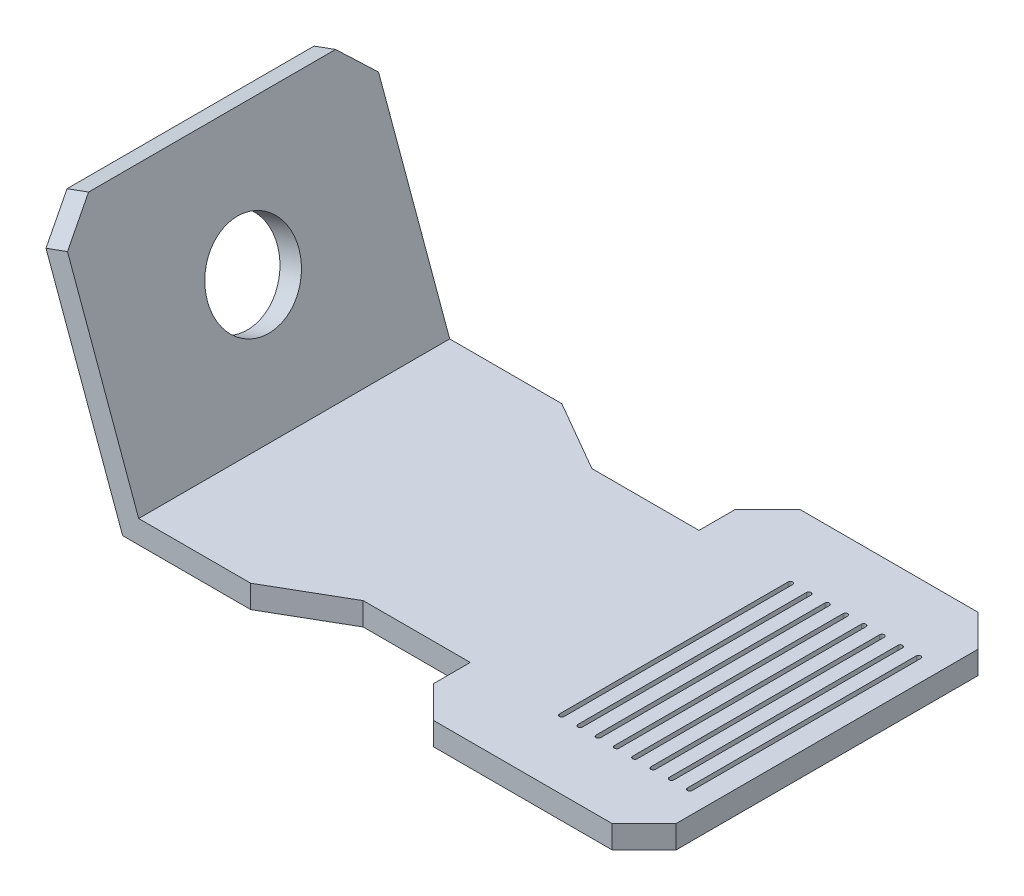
ISO-10303-21;
HEADER;
FILE_DESCRIPTION(('STEP AP214'),'2;1');
FILE_NAME('part.step','',(''),(''),'','','');
FILE_SCHEMA(('AUTOMOTIVE_DESIGN { 1 0 10303 214 1 1 1 1 }'));
ENDSEC;
DATA;
#1=APPLICATION_CONTEXT('core data for automotive mechanical design processes');
#2=APPLICATION_PROTOCOL_DEFINITION('international standard','automotive_design',2000,#1);
#3=PRODUCT_CONTEXT('',#1,'mechanical');
#4=PRODUCT('Part','Part','',(#3));
#5=PRODUCT_RELATED_PRODUCT_CATEGORY('part','',(#4));
#6=PRODUCT_DEFINITION_FORMATION('','',#4);
#7=PRODUCT_DEFINITION_CONTEXT('part definition',#1,'design');
#8=PRODUCT_DEFINITION('design','',#6,#7);
#9=PRODUCT_DEFINITION_SHAPE('','',#8);
#10=(LENGTH_UNIT() NAMED_UNIT(*) SI_UNIT(.MILLI.,.METRE.));
#11=(NAMED_UNIT(*) PLANE_ANGLE_UNIT() SI_UNIT($,.RADIAN.));
#12=(NAMED_UNIT(*) SI_UNIT($,.STERADIAN.) SOLID_ANGLE_UNIT());
#13=UNCERTAINTY_MEASURE_WITH_UNIT(LENGTH_MEASURE(1.E-05),#10,'distance_accuracy_value','');
#14=(GEOMETRIC_REPRESENTATION_CONTEXT(3) GLOBAL_UNCERTAINTY_ASSIGNED_CONTEXT((#13)) GLOBAL_UNIT_ASSIGNED_CONTEXT((#10,
#11,#12)) REPRESENTATION_CONTEXT('',''));
#15=CARTESIAN_POINT('',(0.,0.,0.));
#16=DIRECTION('',(0.,0.,1.));
#17=DIRECTION('',(1.,0.,0.));
#18=AXIS2_PLACEMENT_3D('',#15,#16,#17);
#19=CARTESIAN_POINT('',(-53.,5.,40.));
#20=DIRECTION('',(0.,-1.,0.));
#21=DIRECTION('',(0.,0.,-1.));
#22=AXIS2_PLACEMENT_3D('',#19,#20,#21);
#23=PLANE('',#22);
#24=DIRECTION('',(0.,0.,-1.));
#25=VECTOR('',#24,1.);
#26=CARTESIAN_POINT('',(-8.5,5.,25.));
#27=LINE('',#26,#25);
#28=CARTESIAN_POINT('',(-8.5,5.,25.));
#29=VERTEX_POINT('',#28);
#30=CARTESIAN_POINT('',(-8.5,5.,-25.));
#31=VERTEX_POINT('',#30);
#32=EDGE_CURVE('E368',#29,#31,#27,.T.);
#33=ORIENTED_EDGE('',*,*,#32,.F.);
#34=CARTESIAN_POINT('',(-9.,5.,25.));
#35=DIRECTION('',(0.,1.,0.));
#36=DIRECTION('',(0.,0.,1.));
#37=AXIS2_PLACEMENT_3D('',#34,#35,#36);
#38=CIRCLE('',#37,0.5);
#39=CARTESIAN_POINT('',(-9.5,5.,25.));
#40=VERTEX_POINT('',#39);
#41=EDGE_CURVE('E404',#40,#29,#38,.T.);
#42=ORIENTED_EDGE('',*,*,#41,.F.);
#43=DIRECTION('',(0.,0.,1.));
#44=VECTOR('',#43,1.);
#45=CARTESIAN_POINT('',(-9.5,5.,25.));
#46=LINE('',#45,#44);
#47=CARTESIAN_POINT('',(-9.5,5.,-25.));
#48=VERTEX_POINT('',#47);
#49=EDGE_CURVE('E390',#48,#40,#46,.T.);
#50=ORIENTED_EDGE('',*,*,#49,.F.);
#51=CARTESIAN_POINT('',(-9.,5.,-25.));
#52=DIRECTION('',(0.,1.,0.));
#53=DIRECTION('',(0.,0.,1.));
#54=AXIS2_PLACEMENT_3D('',#51,#52,#53);
#55=CIRCLE('',#54,0.5);
#56=EDGE_CURVE('E383',#31,#48,#55,.T.);
#57=ORIENTED_EDGE('',*,*,#56,.F.);
#58=EDGE_LOOP('',(#33,#42,#50,#57));
#59=FACE_BOUND('',#58,.T.);
#60=DIRECTION('',(0.,0.,-1.));
#61=VECTOR('',#60,1.);
#62=CARTESIAN_POINT('',(-4.5,5.,25.));
#63=LINE('',#62,#61);
#64=CARTESIAN_POINT('',(-4.5,5.,25.));
#65=VERTEX_POINT('',#64);
#66=CARTESIAN_POINT('',(-4.5,5.,-25.));
#67=VERTEX_POINT('',#66);
#68=EDGE_CURVE('E425',#65,#67,#63,.T.);
#69=ORIENTED_EDGE('',*,*,#68,.F.);
#70=CARTESIAN_POINT('',(-5.,5.,25.));
#71=DIRECTION('',(0.,1.,0.));
#72=DIRECTION('',(0.,0.,1.));
#73=AXIS2_PLACEMENT_3D('',#70,#71,#72);
#74=CIRCLE('',#73,0.5);
#75=CARTESIAN_POINT('',(-5.5,5.,25.));
#76=VERTEX_POINT('',#75);
#77=EDGE_CURVE('E409',#76,#65,#74,.T.);
#78=ORIENTED_EDGE('',*,*,#77,.F.);
#79=DIRECTION('',(0.,0.,1.));
#80=VECTOR('',#79,1.);
#81=CARTESIAN_POINT('',(-5.5,5.,25.));
#82=LINE('',#81,#80);
#83=CARTESIAN_POINT('',(-5.5,5.,-25.));
#84=VERTEX_POINT('',#83);
#85=EDGE_CURVE('E414',#84,#76,#82,.T.);
#86=ORIENTED_EDGE('',*,*,#85,.F.);
#87=CARTESIAN_POINT('',(-5.,5.,-25.));
#88=DIRECTION('',(0.,1.,0.));
#89=DIRECTION('',(0.,0.,1.));
#90=AXIS2_PLACEMENT_3D('',#87,#88,#89);
#91=CIRCLE('',#90,0.5);
#92=EDGE_CURVE('E428',#67,#84,#91,.T.);
#93=ORIENTED_EDGE('',*,*,#92,.F.);
#94=EDGE_LOOP('',(#69,#78,#86,#93));
#95=FACE_BOUND('',#94,.T.);
#96=DIRECTION('',(-1.,0.,0.));
#97=VECTOR('',#96,1.);
#98=CARTESIAN_POINT('',(0.,5.,-40.));
#99=LINE('',#98,#97);
#100=CARTESIAN_POINT('',(-7.,5.,-40.));
#101=VERTEX_POINT('',#100);
#102=CARTESIAN_POINT('',(-46.,5.,-40.));
#103=VERTEX_POINT('',#102);
#104=EDGE_CURVE('E462',#101,#103,#99,.T.);
#105=ORIENTED_EDGE('',*,*,#104,.T.);
#106=DIRECTION('',(0.707106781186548,0.,-0.707106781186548));
#107=VECTOR('',#106,1.);
#108=CARTESIAN_POINT('',(-53.,5.,-33.));
#109=LINE('',#108,#107);
#110=CARTESIAN_POINT('',(-53.,5.,-33.));
#111=VERTEX_POINT('',#110);
#112=EDGE_CURVE('E748',#103,#111,#109,.F.);
#113=ORIENTED_EDGE('',*,*,#112,.T.);
#114=DIRECTION('',(0.,0.,1.));
#115=VECTOR('',#114,1.);
#116=CARTESIAN_POINT('',(-53.,5.,-40.));
#117=LINE('',#116,#115);
#118=CARTESIAN_POINT('',(-53.,5.,-25.));
#119=VERTEX_POINT('',#118);
#120=EDGE_CURVE('E465',#111,#119,#117,.T.);
#121=ORIENTED_EDGE('',*,*,#120,.T.);
#122=DIRECTION('',(-1.,0.,0.));
#123=VECTOR('',#122,1.);
#124=CARTESIAN_POINT('',(-53.,5.,-25.));
#125=LINE('',#124,#123);
#126=CARTESIAN_POINT('',(-76.4115427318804,5.,-25.));
#127=VERTEX_POINT('',#126);
#128=EDGE_CURVE('E467',#119,#127,#125,.T.);
#129=ORIENTED_EDGE('',*,*,#128,.T.);
#130=DIRECTION('',(-0.866025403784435,0.,-0.500000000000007));
#131=VECTOR('',#130,1.);
#132=CARTESIAN_POINT('',(-76.4115427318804,5.,-25.));
#133=LINE('',#132,#131);
#134=CARTESIAN_POINT('',(-92.,5.,-34.));
#135=VERTEX_POINT('',#134);
#136=EDGE_CURVE('E469',#127,#135,#133,.T.);
#137=ORIENTED_EDGE('',*,*,#136,.T.);
#138=DIRECTION('',(-1.,0.,0.));
#139=VECTOR('',#138,1.);
#140=CARTESIAN_POINT('',(-92.,5.,-34.));
#141=LINE('',#140,#139);
#142=CARTESIAN_POINT('',(-116.498962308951,5.,-34.));
#143=VERTEX_POINT('',#142);
#144=EDGE_CURVE('E471',#135,#143,#141,.T.);
#145=ORIENTED_EDGE('',*,*,#144,.T.);
#146=DIRECTION('',(0.,0.,-1.));
#147=VECTOR('',#146,1.);
#148=CARTESIAN_POINT('',(-116.498962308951,5.,40.));
#149=LINE('',#148,#147);
#150=CARTESIAN_POINT('',(-116.498962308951,5.,34.));
#151=VERTEX_POINT('',#150);
#152=EDGE_CURVE('E528',#151,#143,#149,.T.);
#153=ORIENTED_EDGE('',*,*,#152,.F.);
#154=DIRECTION('',(1.,0.,0.));
#155=VECTOR('',#154,1.);
#156=CARTESIAN_POINT('',(-92.,5.,34.));
#157=LINE('',#156,#155);
#158=CARTESIAN_POINT('',(-92.,5.,34.));
#159=VERTEX_POINT('',#158);
#160=EDGE_CURVE('E474',#151,#159,#157,.T.);
#161=ORIENTED_EDGE('',*,*,#160,.T.);
#162=DIRECTION('',(0.866025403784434,0.,-0.500000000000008));
#163=VECTOR('',#162,1.);
#164=CARTESIAN_POINT('',(-76.4115427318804,5.,25.));
#165=LINE('',#164,#163);
#166=CARTESIAN_POINT('',(-76.4115427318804,5.,25.));
#167=VERTEX_POINT('',#166);
#168=EDGE_CURVE('E476',#159,#167,#165,.T.);
#169=ORIENTED_EDGE('',*,*,#168,.T.);
#170=DIRECTION('',(1.,0.,0.));
#171=VECTOR('',#170,1.);
#172=CARTESIAN_POINT('',(-53.,5.,25.));
#173=LINE('',#172,#171);
#174=CARTESIAN_POINT('',(-53.,5.,25.));
#175=VERTEX_POINT('',#174);
#176=EDGE_CURVE('E478',#167,#175,#173,.T.);
#177=ORIENTED_EDGE('',*,*,#176,.T.);
#178=DIRECTION('',(0.,0.,1.));
#179=VECTOR('',#178,1.);
#180=CARTESIAN_POINT('',(-53.,5.,40.));
#181=LINE('',#180,#179);
#182=CARTESIAN_POINT('',(-53.,5.,33.));
#183=VERTEX_POINT('',#182);
#184=EDGE_CURVE('E480',#175,#183,#181,.T.);
#185=ORIENTED_EDGE('',*,*,#184,.T.);
#186=DIRECTION('',(-0.707106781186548,0.,-0.707106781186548));
#187=VECTOR('',#186,1.);
#188=CARTESIAN_POINT('',(-46.,5.,40.));
#189=LINE('',#188,#187);
#190=CARTESIAN_POINT('',(-46.,5.,40.));
#191=VERTEX_POINT('',#190);
#192=EDGE_CURVE('E744',#183,#191,#189,.F.);
#193=ORIENTED_EDGE('',*,*,#192,.T.);
#194=DIRECTION('',(1.,0.,0.));
#195=VECTOR('',#194,1.);
#196=CARTESIAN_POINT('',(0.,5.,40.));
#197=LINE('',#196,#195);
#198=CARTESIAN_POINT('',(-7.00000000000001,5.,40.));
#199=VERTEX_POINT('',#198);
#200=EDGE_CURVE('E455',#191,#199,#197,.T.);
#201=ORIENTED_EDGE('',*,*,#200,.T.);
#202=DIRECTION('',(-0.707106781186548,0.,0.707106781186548));
#203=VECTOR('',#202,1.);
#204=CARTESIAN_POINT('',(0.,5.,33.));
#205=LINE('',#204,#203);
#206=CARTESIAN_POINT('',(0.,5.,33.));
#207=VERTEX_POINT('',#206);
#208=EDGE_CURVE('E742',#199,#207,#205,.F.);
#209=ORIENTED_EDGE('',*,*,#208,.T.);
#210=DIRECTION('',(0.,0.,-1.));
#211=VECTOR('',#210,1.);
#212=CARTESIAN_POINT('',(0.,5.,40.));
#213=LINE('',#212,#211);
#214=CARTESIAN_POINT('',(0.,5.,-33.));
#215=VERTEX_POINT('',#214);
#216=EDGE_CURVE('E458',#207,#215,#213,.T.);
#217=ORIENTED_EDGE('',*,*,#216,.T.);
#218=DIRECTION('',(0.707106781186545,0.,0.70710678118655));
#219=VECTOR('',#218,1.);
#220=CARTESIAN_POINT('',(-7.,5.,-40.));
#221=LINE('',#220,#219);
#222=EDGE_CURVE('E746',#215,#101,#221,.F.);
#223=ORIENTED_EDGE('',*,*,#222,.T.);
#224=EDGE_LOOP('',(#105,#113,#121,#129,#137,#145,#153,#161,#169,#177,#185,#193,#201,#209,#217,#223));
#225=FACE_BOUND('',#224,.T.);
#226=CARTESIAN_POINT('',(-13.,5.,25.));
#227=DIRECTION('',(0.,1.,0.));
#228=DIRECTION('',(0.,0.,1.));
#229=AXIS2_PLACEMENT_3D('',#226,#227,#228);
#230=CIRCLE('',#229,0.5);
#231=CARTESIAN_POINT('',(-13.5,5.,25.));
#232=VERTEX_POINT('',#231);
#233=CARTESIAN_POINT('',(-12.5,5.,25.));
#234=VERTEX_POINT('',#233);
#235=EDGE_CURVE('E531',#232,#234,#230,.T.);
#236=ORIENTED_EDGE('',*,*,#235,.F.);
#237=DIRECTION('',(0.,0.,1.));
#238=VECTOR('',#237,1.);
#239=CARTESIAN_POINT('',(-13.5,5.,25.));
#240=LINE('',#239,#238);
#241=CARTESIAN_POINT('',(-13.5,5.,-25.));
#242=VERTEX_POINT('',#241);
#243=EDGE_CURVE('E533',#242,#232,#240,.T.);
#244=ORIENTED_EDGE('',*,*,#243,.F.);
#245=CARTESIAN_POINT('',(-13.,5.,-25.));
#246=DIRECTION('',(0.,1.,0.));
#247=DIRECTION('',(0.,0.,1.));
#248=AXIS2_PLACEMENT_3D('',#245,#246,#247);
#249=CIRCLE('',#248,0.5);
#250=CARTESIAN_POINT('',(-12.5,5.,-25.));
#251=VERTEX_POINT('',#250);
#252=EDGE_CURVE('E536',#251,#242,#249,.T.);
#253=ORIENTED_EDGE('',*,*,#252,.F.);
#254=DIRECTION('',(0.,0.,-1.));
#255=VECTOR('',#254,1.);
#256=CARTESIAN_POINT('',(-12.5,5.,25.));
#257=LINE('',#256,#255);
#258=EDGE_CURVE('E539',#234,#251,#257,.T.);
#259=ORIENTED_EDGE('',*,*,#258,.F.);
#260=EDGE_LOOP('',(#236,#244,#253,#259));
#261=FACE_BOUND('',#260,.T.);
#262=CARTESIAN_POINT('',(-17.,5.,25.));
#263=DIRECTION('',(0.,1.,0.));
#264=DIRECTION('',(0.,0.,1.));
#265=AXIS2_PLACEMENT_3D('',#262,#263,#264);
#266=CIRCLE('',#265,0.5);
#267=CARTESIAN_POINT('',(-17.5,5.,25.));
#268=VERTEX_POINT('',#267);
#269=CARTESIAN_POINT('',(-16.5,5.,25.));
#270=VERTEX_POINT('',#269);
#271=EDGE_CURVE('E563',#268,#270,#266,.T.);
#272=ORIENTED_EDGE('',*,*,#271,.F.);
#273=DIRECTION('',(0.,0.,1.));
#274=VECTOR('',#273,1.);
#275=CARTESIAN_POINT('',(-17.5,5.,25.));
#276=LINE('',#275,#274);
#277=CARTESIAN_POINT('',(-17.5,5.,-25.));
#278=VERTEX_POINT('',#277);
#279=EDGE_CURVE('E565',#278,#268,#276,.T.);
#280=ORIENTED_EDGE('',*,*,#279,.F.);
#281=CARTESIAN_POINT('',(-17.,5.,-25.));
#282=DIRECTION('',(0.,1.,0.));
#283=DIRECTION('',(0.,0.,1.));
#284=AXIS2_PLACEMENT_3D('',#281,#282,#283);
#285=CIRCLE('',#284,0.5);
#286=CARTESIAN_POINT('',(-16.5,5.,-25.));
#287=VERTEX_POINT('',#286);
#288=EDGE_CURVE('E568',#287,#278,#285,.T.);
#289=ORIENTED_EDGE('',*,*,#288,.F.);
#290=DIRECTION('',(0.,0.,-1.));
#291=VECTOR('',#290,1.);
#292=CARTESIAN_POINT('',(-16.5,5.,25.));
#293=LINE('',#292,#291);
#294=EDGE_CURVE('E571',#270,#287,#293,.T.);
#295=ORIENTED_EDGE('',*,*,#294,.F.);
#296=EDGE_LOOP('',(#272,#280,#289,#295));
#297=FACE_BOUND('',#296,.T.);
#298=CARTESIAN_POINT('',(-21.,5.,25.));
#299=DIRECTION('',(0.,1.,0.));
#300=DIRECTION('',(0.,0.,1.));
#301=AXIS2_PLACEMENT_3D('',#298,#299,#300);
#302=CIRCLE('',#301,0.5);
#303=CARTESIAN_POINT('',(-21.5,5.,25.));
#304=VERTEX_POINT('',#303);
#305=CARTESIAN_POINT('',(-20.5,5.,25.));
#306=VERTEX_POINT('',#305);
#307=EDGE_CURVE('E595',#304,#306,#302,.T.);
#308=ORIENTED_EDGE('',*,*,#307,.F.);
#309=DIRECTION('',(0.,0.,1.));
#310=VECTOR('',#309,1.);
#311=CARTESIAN_POINT('',(-21.5,5.,25.));
#312=LINE('',#311,#310);
#313=CARTESIAN_POINT('',(-21.5,5.,-25.));
#314=VERTEX_POINT('',#313);
#315=EDGE_CURVE('E597',#314,#304,#312,.T.);
#316=ORIENTED_EDGE('',*,*,#315,.F.);
#317=CARTESIAN_POINT('',(-21.,5.,-25.));
#318=DIRECTION('',(0.,1.,0.));
#319=DIRECTION('',(0.,0.,1.));
#320=AXIS2_PLACEMENT_3D('',#317,#318,#319);
#321=CIRCLE('',#320,0.5);
#322=CARTESIAN_POINT('',(-20.5,5.,-25.));
#323=VERTEX_POINT('',#322);
#324=EDGE_CURVE('E600',#323,#314,#321,.T.);
#325=ORIENTED_EDGE('',*,*,#324,.F.);
#326=DIRECTION('',(0.,0.,-1.));
#327=VECTOR('',#326,1.);
#328=CARTESIAN_POINT('',(-20.5,5.,25.));
#329=LINE('',#328,#327);
#330=EDGE_CURVE('E603',#306,#323,#329,.T.);
#331=ORIENTED_EDGE('',*,*,#330,.F.);
#332=EDGE_LOOP('',(#308,#316,#325,#331));
#333=FACE_BOUND('',#332,.T.);
#334=CARTESIAN_POINT('',(-25.,5.,25.));
#335=DIRECTION('',(0.,1.,0.));
#336=DIRECTION('',(0.,0.,1.));
#337=AXIS2_PLACEMENT_3D('',#334,#335,#336);
#338=CIRCLE('',#337,0.5);
#339=CARTESIAN_POINT('',(-25.5,5.,25.));
#340=VERTEX_POINT('',#339);
#341=CARTESIAN_POINT('',(-24.5,5.,25.));
#342=VERTEX_POINT('',#341);
#343=EDGE_CURVE('E627',#340,#342,#338,.T.);
#344=ORIENTED_EDGE('',*,*,#343,.F.);
#345=DIRECTION('',(0.,0.,1.));
#346=VECTOR('',#345,1.);
#347=CARTESIAN_POINT('',(-25.5,5.,25.));
#348=LINE('',#347,#346);
#349=CARTESIAN_POINT('',(-25.5,5.,-25.));
#350=VERTEX_POINT('',#349);
#351=EDGE_CURVE('E629',#350,#340,#348,.T.);
#352=ORIENTED_EDGE('',*,*,#351,.F.);
#353=CARTESIAN_POINT('',(-25.,5.,-25.));
#354=DIRECTION('',(0.,1.,0.));
#355=DIRECTION('',(0.,0.,1.));
#356=AXIS2_PLACEMENT_3D('',#353,#354,#355);
#357=CIRCLE('',#356,0.5);
#358=CARTESIAN_POINT('',(-24.5,5.,-25.));
#359=VERTEX_POINT('',#358);
#360=EDGE_CURVE('E632',#359,#350,#357,.T.);
#361=ORIENTED_EDGE('',*,*,#360,.F.);
#362=DIRECTION('',(0.,0.,-1.));
#363=VECTOR('',#362,1.);
#364=CARTESIAN_POINT('',(-24.5,5.,25.));
#365=LINE('',#364,#363);
#366=EDGE_CURVE('E635',#342,#359,#365,.T.);
#367=ORIENTED_EDGE('',*,*,#366,.F.);
#368=EDGE_LOOP('',(#344,#352,#361,#367));
#369=FACE_BOUND('',#368,.T.);
#370=CARTESIAN_POINT('',(-29.,5.,25.));
#371=DIRECTION('',(0.,1.,0.));
#372=DIRECTION('',(0.,0.,1.));
#373=AXIS2_PLACEMENT_3D('',#370,#371,#372);
#374=CIRCLE('',#373,0.5);
#375=CARTESIAN_POINT('',(-29.5,5.,25.));
#376=VERTEX_POINT('',#375);
#377=CARTESIAN_POINT('',(-28.5,5.,25.));
#378=VERTEX_POINT('',#377);
#379=EDGE_CURVE('E659',#376,#378,#374,.T.);
#380=ORIENTED_EDGE('',*,*,#379,.F.);
#381=DIRECTION('',(0.,0.,1.));
#382=VECTOR('',#381,1.);
#383=CARTESIAN_POINT('',(-29.5,5.,25.));
#384=LINE('',#383,#382);
#385=CARTESIAN_POINT('',(-29.5,5.,-25.));
#386=VERTEX_POINT('',#385);
#387=EDGE_CURVE('E661',#386,#376,#384,.T.);
#388=ORIENTED_EDGE('',*,*,#387,.F.);
#389=CARTESIAN_POINT('',(-29.,5.,-25.));
#390=DIRECTION('',(0.,1.,0.));
#391=DIRECTION('',(0.,0.,1.));
#392=AXIS2_PLACEMENT_3D('',#389,#390,#391);
#393=CIRCLE('',#392,0.5);
#394=CARTESIAN_POINT('',(-28.5,5.,-25.));
#395=VERTEX_POINT('',#394);
#396=EDGE_CURVE('E664',#395,#386,#393,.T.);
#397=ORIENTED_EDGE('',*,*,#396,.F.);
#398=DIRECTION('',(0.,0.,-1.));
#399=VECTOR('',#398,1.);
#400=CARTESIAN_POINT('',(-28.5,5.,25.));
#401=LINE('',#400,#399);
#402=EDGE_CURVE('E667',#378,#395,#401,.T.);
#403=ORIENTED_EDGE('',*,*,#402,.F.);
#404=EDGE_LOOP('',(#380,#388,#397,#403));
#405=FACE_BOUND('',#404,.T.);
#406=CARTESIAN_POINT('',(-33.,5.,25.));
#407=DIRECTION('',(0.,1.,0.));
#408=DIRECTION('',(0.,0.,1.));
#409=AXIS2_PLACEMENT_3D('',#406,#407,#408);
#410=CIRCLE('',#409,0.5);
#411=CARTESIAN_POINT('',(-33.5,5.,25.));
#412=VERTEX_POINT('',#411);
#413=CARTESIAN_POINT('',(-32.5,5.,25.));
#414=VERTEX_POINT('',#413);
#415=EDGE_CURVE('E691',#412,#414,#410,.T.);
#416=ORIENTED_EDGE('',*,*,#415,.F.);
#417=DIRECTION('',(0.,0.,1.));
#418=VECTOR('',#417,1.);
#419=CARTESIAN_POINT('',(-33.5,5.,25.));
#420=LINE('',#419,#418);
#421=CARTESIAN_POINT('',(-33.5,5.,-25.));
#422=VERTEX_POINT('',#421);
#423=EDGE_CURVE('E693',#422,#412,#420,.T.);
#424=ORIENTED_EDGE('',*,*,#423,.F.);
#425=CARTESIAN_POINT('',(-33.,5.,-25.));
#426=DIRECTION('',(0.,1.,0.));
#427=DIRECTION('',(0.,0.,1.));
#428=AXIS2_PLACEMENT_3D('',#425,#426,#427);
#429=CIRCLE('',#428,0.5);
#430=CARTESIAN_POINT('',(-32.5,5.,-25.));
#431=VERTEX_POINT('',#430);
#432=EDGE_CURVE('E697',#431,#422,#429,.T.);
#433=ORIENTED_EDGE('',*,*,#432,.F.);
#434=DIRECTION('',(0.,0.,-1.));
#435=VECTOR('',#434,1.);
#436=CARTESIAN_POINT('',(-32.5,5.,25.));
#437=LINE('',#436,#435);
#438=EDGE_CURVE('E700',#414,#431,#437,.T.);
#439=ORIENTED_EDGE('',*,*,#438,.F.);
#440=EDGE_LOOP('',(#416,#424,#433,#439));
#441=FACE_BOUND('',#440,.T.);
#442=ADVANCED_FACE('F36',(#59,#95,#225,#261,#297,#333,#369,#405,#441),#23,.F.);
#443=CARTESIAN_POINT('',(0.,5.,40.));
#444=DIRECTION('',(0.,0.,-1.));
#445=DIRECTION('',(-1.,0.,0.));
#446=AXIS2_PLACEMENT_3D('',#443,#444,#445);
#447=PLANE('',#446);
#448=ORIENTED_EDGE('',*,*,#200,.F.);
#449=DIRECTION('',(0.,-1.,0.));
#450=VECTOR('',#449,1.);
#451=CARTESIAN_POINT('',(-46.,5.,40.));
#452=LINE('',#451,#450);
#453=CARTESIAN_POINT('',(-46.,0.,40.));
#454=VERTEX_POINT('',#453);
#455=EDGE_CURVE('E757',#191,#454,#452,.T.);
#456=ORIENTED_EDGE('',*,*,#455,.T.);
#457=DIRECTION('',(1.,0.,0.));
#458=VECTOR('',#457,1.);
#459=CARTESIAN_POINT('',(0.,0.,40.));
#460=LINE('',#459,#458);
#461=CARTESIAN_POINT('',(-7.00000000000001,0.,40.));
#462=VERTEX_POINT('',#461);
#463=EDGE_CURVE('E449',#454,#462,#460,.T.);
#464=ORIENTED_EDGE('',*,*,#463,.T.);
#465=DIRECTION('',(0.,1.,0.));
#466=VECTOR('',#465,1.);
#467=CARTESIAN_POINT('',(-7.00000000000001,5.,40.));
#468=LINE('',#467,#466);
#469=EDGE_CURVE('E755',#462,#199,#468,.T.);
#470=ORIENTED_EDGE('',*,*,#469,.T.);
#471=EDGE_LOOP('',(#448,#456,#464,#470));
#472=FACE_BOUND('',#471,.T.);
#473=ADVANCED_FACE('F831',(#472),#447,.F.);
#474=CARTESIAN_POINT('',(0.,5.,40.));
#475=DIRECTION('',(-1.,0.,0.));
#476=DIRECTION('',(0.,0.,1.));
#477=AXIS2_PLACEMENT_3D('',#474,#475,#476);
#478=PLANE('',#477);
#479=DIRECTION('',(0.,0.,-1.));
#480=VECTOR('',#479,1.);
#481=CARTESIAN_POINT('',(0.,0.,40.));
#482=LINE('',#481,#480);
#483=CARTESIAN_POINT('',(0.,0.,33.));
#484=VERTEX_POINT('',#483);
#485=CARTESIAN_POINT('',(0.,0.,-33.));
#486=VERTEX_POINT('',#485);
#487=EDGE_CURVE('E486',#484,#486,#482,.T.);
#488=ORIENTED_EDGE('',*,*,#487,.T.);
#489=DIRECTION('',(0.,1.,0.));
#490=VECTOR('',#489,1.);
#491=CARTESIAN_POINT('',(0.,5.,-33.));
#492=LINE('',#491,#490);
#493=EDGE_CURVE('E753',#486,#215,#492,.T.);
#494=ORIENTED_EDGE('',*,*,#493,.T.);
#495=ORIENTED_EDGE('',*,*,#216,.F.);
#496=DIRECTION('',(0.,-1.,0.));
#497=VECTOR('',#496,1.);
#498=CARTESIAN_POINT('',(0.,5.,33.));
#499=LINE('',#498,#497);
#500=EDGE_CURVE('E750',#207,#484,#499,.T.);
#501=ORIENTED_EDGE('',*,*,#500,.T.);
#502=EDGE_LOOP('',(#488,#494,#495,#501));
#503=FACE_BOUND('',#502,.T.);
#504=ADVANCED_FACE('F840',(#503),#478,.F.);
#505=CARTESIAN_POINT('',(0.,5.,-40.));
#506=DIRECTION('',(0.,0.,1.));
#507=DIRECTION('',(1.,0.,0.));
#508=AXIS2_PLACEMENT_3D('',#505,#506,#507);
#509=PLANE('',#508);
#510=DIRECTION('',(-1.,0.,0.));
#511=VECTOR('',#510,1.);
#512=CARTESIAN_POINT('',(0.,0.,-40.));
#513=LINE('',#512,#511);
#514=CARTESIAN_POINT('',(-6.99999999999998,0.,-40.));
#515=VERTEX_POINT('',#514);
#516=CARTESIAN_POINT('',(-46.,0.,-40.));
#517=VERTEX_POINT('',#516);
#518=EDGE_CURVE('E489',#515,#517,#513,.T.);
#519=ORIENTED_EDGE('',*,*,#518,.T.);
#520=DIRECTION('',(0.,1.,0.));
#521=VECTOR('',#520,1.);
#522=CARTESIAN_POINT('',(-46.,5.,-40.));
#523=LINE('',#522,#521);
#524=EDGE_CURVE('E740',#517,#103,#523,.T.);
#525=ORIENTED_EDGE('',*,*,#524,.T.);
#526=ORIENTED_EDGE('',*,*,#104,.F.);
#527=DIRECTION('',(0.,-1.,0.));
#528=VECTOR('',#527,1.);
#529=CARTESIAN_POINT('',(-7.,5.,-40.));
#530=LINE('',#529,#528);
#531=EDGE_CURVE('E737',#101,#515,#530,.T.);
#532=ORIENTED_EDGE('',*,*,#531,.T.);
#533=EDGE_LOOP('',(#519,#525,#526,#532));
#534=FACE_BOUND('',#533,.T.);
#535=ADVANCED_FACE('F849',(#534),#509,.F.);
#536=CARTESIAN_POINT('',(-53.,5.,-40.));
#537=DIRECTION('',(1.,0.,0.));
#538=DIRECTION('',(0.,0.,-1.));
#539=AXIS2_PLACEMENT_3D('',#536,#537,#538);
#540=PLANE('',#539);
#541=ORIENTED_EDGE('',*,*,#120,.F.);
#542=DIRECTION('',(0.,-1.,0.));
#543=VECTOR('',#542,1.);
#544=CARTESIAN_POINT('',(-53.,5.,-33.));
#545=LINE('',#544,#543);
#546=CARTESIAN_POINT('',(-53.,0.,-33.));
#547=VERTEX_POINT('',#546);
#548=EDGE_CURVE('E726',#111,#547,#545,.T.);
#549=ORIENTED_EDGE('',*,*,#548,.T.);
#550=DIRECTION('',(0.,0.,1.));
#551=VECTOR('',#550,1.);
#552=CARTESIAN_POINT('',(-53.,0.,-40.));
#553=LINE('',#552,#551);
#554=CARTESIAN_POINT('',(-53.,0.,-25.));
#555=VERTEX_POINT('',#554);
#556=EDGE_CURVE('E492',#547,#555,#553,.T.);
#557=ORIENTED_EDGE('',*,*,#556,.T.);
#558=DIRECTION('',(0.,-1.,0.));
#559=VECTOR('',#558,1.);
#560=CARTESIAN_POINT('',(-53.,5.,-25.));
#561=LINE('',#560,#559);
#562=EDGE_CURVE('E525',#119,#555,#561,.T.);
#563=ORIENTED_EDGE('',*,*,#562,.F.);
#564=EDGE_LOOP('',(#541,#549,#557,#563));
#565=FACE_BOUND('',#564,.T.);
#566=ADVANCED_FACE('F857',(#565),#540,.F.);
#567=CARTESIAN_POINT('',(-53.,5.,-25.));
#568=DIRECTION('',(0.,0.,1.));
#569=DIRECTION('',(1.,0.,0.));
#570=AXIS2_PLACEMENT_3D('',#567,#568,#569);
#571=PLANE('',#570);
#572=DIRECTION('',(-1.,0.,0.));
#573=VECTOR('',#572,1.);
#574=CARTESIAN_POINT('',(-53.,0.,-25.));
#575=LINE('',#574,#573);
#576=CARTESIAN_POINT('',(-76.4115427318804,0.,-25.));
#577=VERTEX_POINT('',#576);
#578=EDGE_CURVE('E494',#555,#577,#575,.T.);
#579=ORIENTED_EDGE('',*,*,#578,.T.);
#580=DIRECTION('',(0.,-1.,0.));
#581=VECTOR('',#580,1.);
#582=CARTESIAN_POINT('',(-76.4115427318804,5.,-25.));
#583=LINE('',#582,#581);
#584=EDGE_CURVE('E522',#127,#577,#583,.T.);
#585=ORIENTED_EDGE('',*,*,#584,.F.);
#586=ORIENTED_EDGE('',*,*,#128,.F.);
#587=ORIENTED_EDGE('',*,*,#562,.T.);
#588=EDGE_LOOP('',(#579,#585,#586,#587));
#589=FACE_BOUND('',#588,.T.);
#590=ADVANCED_FACE('F862',(#589),#571,.F.);
#591=CARTESIAN_POINT('',(-76.4115427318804,5.,-25.));
#592=DIRECTION('',(-0.500000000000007,0.,0.866025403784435));
#593=DIRECTION('',(0.866025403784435,0.,0.500000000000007));
#594=AXIS2_PLACEMENT_3D('',#591,#592,#593);
#595=PLANE('',#594);
#596=DIRECTION('',(-0.866025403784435,0.,-0.500000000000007));
#597=VECTOR('',#596,1.);
#598=CARTESIAN_POINT('',(-76.4115427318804,0.,-25.));
#599=LINE('',#598,#597);
#600=CARTESIAN_POINT('',(-92.,0.,-34.));
#601=VERTEX_POINT('',#600);
#602=EDGE_CURVE('E496',#577,#601,#599,.T.);
#603=ORIENTED_EDGE('',*,*,#602,.T.);
#604=DIRECTION('',(0.,-1.,0.));
#605=VECTOR('',#604,1.);
#606=CARTESIAN_POINT('',(-92.,5.,-34.));
#607=LINE('',#606,#605);
#608=EDGE_CURVE('E519',#135,#601,#607,.T.);
#609=ORIENTED_EDGE('',*,*,#608,.F.);
#610=ORIENTED_EDGE('',*,*,#136,.F.);
#611=ORIENTED_EDGE('',*,*,#584,.T.);
#612=EDGE_LOOP('',(#603,#609,#610,#611));
#613=FACE_BOUND('',#612,.T.);
#614=ADVANCED_FACE('F863',(#613),#595,.F.);
#615=CARTESIAN_POINT('',(-92.,5.,-34.));
#616=DIRECTION('',(0.,0.,1.));
#617=DIRECTION('',(1.,0.,0.));
#618=AXIS2_PLACEMENT_3D('',#615,#616,#617);
#619=PLANE('',#618);
#620=DIRECTION('',(-0.342020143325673,0.939692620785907,0.));
#621=VECTOR('',#620,1.);
#622=CARTESIAN_POINT('',(-120.,0.,-34.));
#623=LINE('',#622,#621);
#624=CARTESIAN_POINT('',(-120.,0.,-34.));
#625=VERTEX_POINT('',#624);
#626=CARTESIAN_POINT('',(-136.758987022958,46.0449384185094,-34.));
#627=VERTEX_POINT('',#626);
#628=EDGE_CURVE('E435',#625,#627,#623,.T.);
#629=ORIENTED_EDGE('',*,*,#628,.T.);
#630=DIRECTION('',(0.939692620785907,0.342020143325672,0.));
#631=VECTOR('',#630,1.);
#632=CARTESIAN_POINT('',(-110.427395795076,55.6288538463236,-34.));
#633=LINE('',#632,#631);
#634=CARTESIAN_POINT('',(-132.060523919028,47.7550391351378,-34.));
#635=VERTEX_POINT('',#634);
#636=EDGE_CURVE('E762',#627,#635,#633,.T.);
#637=ORIENTED_EDGE('',*,*,#636,.T.);
#638=DIRECTION('',(0.342020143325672,-0.939692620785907,0.));
#639=VECTOR('',#638,1.);
#640=CARTESIAN_POINT('',(-115.30153689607,1.71010071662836,-34.));
#641=LINE('',#640,#639);
#642=EDGE_CURVE('E444',#635,#143,#641,.T.);
#643=ORIENTED_EDGE('',*,*,#642,.T.);
#644=ORIENTED_EDGE('',*,*,#144,.F.);
#645=ORIENTED_EDGE('',*,*,#608,.T.);
#646=DIRECTION('',(-1.,0.,0.));
#647=VECTOR('',#646,1.);
#648=CARTESIAN_POINT('',(-92.,0.,-34.));
#649=LINE('',#648,#647);
#650=EDGE_CURVE('E498',#601,#625,#649,.T.);
#651=ORIENTED_EDGE('',*,*,#650,.T.);
#652=EDGE_LOOP('',(#629,#637,#643,#644,#645,#651));
#653=FACE_BOUND('',#652,.T.);
#654=ADVANCED_FACE('F781',(#653),#619,.F.);
#655=CARTESIAN_POINT('',(-92.,5.,34.));
#656=DIRECTION('',(0.,0.,-1.));
#657=DIRECTION('',(-1.,0.,0.));
#658=AXIS2_PLACEMENT_3D('',#655,#656,#657);
#659=PLANE('',#658);
#660=DIRECTION('',(0.342020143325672,-0.939692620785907,0.));
#661=VECTOR('',#660,1.);
#662=CARTESIAN_POINT('',(-115.30153689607,1.71010071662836,34.));
#663=LINE('',#662,#661);
#664=CARTESIAN_POINT('',(-132.060523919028,47.7550391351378,34.));
#665=VERTEX_POINT('',#664);
#666=EDGE_CURVE('E447',#665,#151,#663,.T.);
#667=ORIENTED_EDGE('',*,*,#666,.F.);
#668=DIRECTION('',(-0.939692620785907,-0.342020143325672,0.));
#669=VECTOR('',#668,1.);
#670=CARTESIAN_POINT('',(-110.427395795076,55.6288538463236,34.));
#671=LINE('',#670,#669);
#672=CARTESIAN_POINT('',(-136.758987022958,46.0449384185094,34.));
#673=VERTEX_POINT('',#672);
#674=EDGE_CURVE('E11',#665,#673,#671,.T.);
#675=ORIENTED_EDGE('',*,*,#674,.T.);
#676=DIRECTION('',(-0.342020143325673,0.939692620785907,0.));
#677=VECTOR('',#676,1.);
#678=CARTESIAN_POINT('',(-120.,0.,34.));
#679=LINE('',#678,#677);
#680=CARTESIAN_POINT('',(-120.,0.,34.));
#681=VERTEX_POINT('',#680);
#682=EDGE_CURVE('E450',#681,#673,#679,.T.);
#683=ORIENTED_EDGE('',*,*,#682,.F.);
#684=DIRECTION('',(1.,0.,0.));
#685=VECTOR('',#684,1.);
#686=CARTESIAN_POINT('',(-92.,0.,34.));
#687=LINE('',#686,#685);
#688=CARTESIAN_POINT('',(-92.,0.,34.));
#689=VERTEX_POINT('',#688);
#690=EDGE_CURVE('E503',#681,#689,#687,.T.);
#691=ORIENTED_EDGE('',*,*,#690,.T.);
#692=DIRECTION('',(0.,-1.,0.));
#693=VECTOR('',#692,1.);
#694=CARTESIAN_POINT('',(-92.,5.,34.));
#695=LINE('',#694,#693);
#696=EDGE_CURVE('E516',#159,#689,#695,.T.);
#697=ORIENTED_EDGE('',*,*,#696,.F.);
#698=ORIENTED_EDGE('',*,*,#160,.F.);
#699=EDGE_LOOP('',(#667,#675,#683,#691,#697,#698));
#700=FACE_BOUND('',#699,.T.);
#701=ADVANCED_FACE('F795',(#700),#659,.F.);
#702=CARTESIAN_POINT('',(-76.4115427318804,5.,25.));
#703=DIRECTION('',(-0.500000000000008,0.,-0.866025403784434));
#704=DIRECTION('',(-0.866025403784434,0.,0.500000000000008));
#705=AXIS2_PLACEMENT_3D('',#702,#703,#704);
#706=PLANE('',#705);
#707=DIRECTION('',(0.866025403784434,0.,-0.500000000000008));
#708=VECTOR('',#707,1.);
#709=CARTESIAN_POINT('',(-76.4115427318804,0.,25.));
#710=LINE('',#709,#708);
#711=CARTESIAN_POINT('',(-76.4115427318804,0.,25.));
#712=VERTEX_POINT('',#711);
#713=EDGE_CURVE('E505',#689,#712,#710,.T.);
#714=ORIENTED_EDGE('',*,*,#713,.T.);
#715=DIRECTION('',(0.,-1.,0.));
#716=VECTOR('',#715,1.);
#717=CARTESIAN_POINT('',(-76.4115427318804,5.,25.));
#718=LINE('',#717,#716);
#719=EDGE_CURVE('E513',#167,#712,#718,.T.);
#720=ORIENTED_EDGE('',*,*,#719,.F.);
#721=ORIENTED_EDGE('',*,*,#168,.F.);
#722=ORIENTED_EDGE('',*,*,#696,.T.);
#723=EDGE_LOOP('',(#714,#720,#721,#722));
#724=FACE_BOUND('',#723,.T.);
#725=ADVANCED_FACE('F813',(#724),#706,.F.);
#726=CARTESIAN_POINT('',(-53.,5.,25.));
#727=DIRECTION('',(0.,0.,-1.));
#728=DIRECTION('',(-1.,0.,0.));
#729=AXIS2_PLACEMENT_3D('',#726,#727,#728);
#730=PLANE('',#729);
#731=DIRECTION('',(1.,0.,0.));
#732=VECTOR('',#731,1.);
#733=CARTESIAN_POINT('',(-53.,0.,25.));
#734=LINE('',#733,#732);
#735=CARTESIAN_POINT('',(-53.,0.,25.));
#736=VERTEX_POINT('',#735);
#737=EDGE_CURVE('E507',#712,#736,#734,.T.);
#738=ORIENTED_EDGE('',*,*,#737,.T.);
#739=DIRECTION('',(0.,-1.,0.));
#740=VECTOR('',#739,1.);
#741=CARTESIAN_POINT('',(-53.,5.,25.));
#742=LINE('',#741,#740);
#743=EDGE_CURVE('E483',#175,#736,#742,.T.);
#744=ORIENTED_EDGE('',*,*,#743,.F.);
#745=ORIENTED_EDGE('',*,*,#176,.F.);
#746=ORIENTED_EDGE('',*,*,#719,.T.);
#747=EDGE_LOOP('',(#738,#744,#745,#746));
#748=FACE_BOUND('',#747,.T.);
#749=ADVANCED_FACE('F818',(#748),#730,.F.);
#750=CARTESIAN_POINT('',(-53.,5.,40.));
#751=DIRECTION('',(1.,0.,0.));
#752=DIRECTION('',(0.,0.,-1.));
#753=AXIS2_PLACEMENT_3D('',#750,#751,#752);
#754=PLANE('',#753);
#755=DIRECTION('',(0.,0.,1.));
#756=VECTOR('',#755,1.);
#757=CARTESIAN_POINT('',(-53.,0.,40.));
#758=LINE('',#757,#756);
#759=CARTESIAN_POINT('',(-53.,0.,33.));
#760=VERTEX_POINT('',#759);
#761=EDGE_CURVE('E459',#736,#760,#758,.T.);
#762=ORIENTED_EDGE('',*,*,#761,.T.);
#763=DIRECTION('',(0.,1.,0.));
#764=VECTOR('',#763,1.);
#765=CARTESIAN_POINT('',(-53.,5.,33.));
#766=LINE('',#765,#764);
#767=EDGE_CURVE('E760',#760,#183,#766,.T.);
#768=ORIENTED_EDGE('',*,*,#767,.T.);
#769=ORIENTED_EDGE('',*,*,#184,.F.);
#770=ORIENTED_EDGE('',*,*,#743,.T.);
#771=EDGE_LOOP('',(#762,#768,#769,#770));
#772=FACE_BOUND('',#771,.T.);
#773=ADVANCED_FACE('F822',(#772),#754,.F.);
#774=CARTESIAN_POINT('',(-53.,0.,40.));
#775=DIRECTION('',(0.,-1.,0.));
#776=DIRECTION('',(0.,0.,-1.));
#777=AXIS2_PLACEMENT_3D('',#774,#775,#776);
#778=PLANE('',#777);
#779=CARTESIAN_POINT('',(-9.,0.,25.));
#780=DIRECTION('',(0.,1.,0.));
#781=DIRECTION('',(0.,0.,1.));
#782=AXIS2_PLACEMENT_3D('',#779,#780,#781);
#783=CIRCLE('',#782,0.5);
#784=CARTESIAN_POINT('',(-9.5,0.,25.));
#785=VERTEX_POINT('',#784);
#786=CARTESIAN_POINT('',(-8.5,0.,25.));
#787=VERTEX_POINT('',#786);
#788=EDGE_CURVE('E406',#785,#787,#783,.T.);
#789=ORIENTED_EDGE('',*,*,#788,.T.);
#790=DIRECTION('',(0.,0.,-1.));
#791=VECTOR('',#790,1.);
#792=CARTESIAN_POINT('',(-8.5,0.,25.));
#793=LINE('',#792,#791);
#794=CARTESIAN_POINT('',(-8.5,0.,-25.));
#795=VERTEX_POINT('',#794);
#796=EDGE_CURVE('E378',#787,#795,#793,.T.);
#797=ORIENTED_EDGE('',*,*,#796,.T.);
#798=CARTESIAN_POINT('',(-9.,0.,-25.));
#799=DIRECTION('',(0.,1.,0.));
#800=DIRECTION('',(0.,0.,1.));
#801=AXIS2_PLACEMENT_3D('',#798,#799,#800);
#802=CIRCLE('',#801,0.5);
#803=CARTESIAN_POINT('',(-9.5,0.,-25.));
#804=VERTEX_POINT('',#803);
#805=EDGE_CURVE('E386',#795,#804,#802,.T.);
#806=ORIENTED_EDGE('',*,*,#805,.T.);
#807=DIRECTION('',(0.,0.,1.));
#808=VECTOR('',#807,1.);
#809=CARTESIAN_POINT('',(-9.5,0.,25.));
#810=LINE('',#809,#808);
#811=EDGE_CURVE('E401',#804,#785,#810,.T.);
#812=ORIENTED_EDGE('',*,*,#811,.T.);
#813=EDGE_LOOP('',(#789,#797,#806,#812));
#814=FACE_BOUND('',#813,.T.);
#815=CARTESIAN_POINT('',(-5.,0.,25.));
#816=DIRECTION('',(0.,1.,0.));
#817=DIRECTION('',(0.,0.,1.));
#818=AXIS2_PLACEMENT_3D('',#815,#816,#817);
#819=CIRCLE('',#818,0.5);
#820=CARTESIAN_POINT('',(-5.5,0.,25.));
#821=VERTEX_POINT('',#820);
#822=CARTESIAN_POINT('',(-4.5,0.,25.));
#823=VERTEX_POINT('',#822);
#824=EDGE_CURVE('E410',#821,#823,#819,.T.);
#825=ORIENTED_EDGE('',*,*,#824,.T.);
#826=DIRECTION('',(0.,0.,-1.));
#827=VECTOR('',#826,1.);
#828=CARTESIAN_POINT('',(-4.5,0.,25.));
#829=LINE('',#828,#827);
#830=CARTESIAN_POINT('',(-4.5,0.,-25.));
#831=VERTEX_POINT('',#830);
#832=EDGE_CURVE('E413',#823,#831,#829,.T.);
#833=ORIENTED_EDGE('',*,*,#832,.T.);
#834=CARTESIAN_POINT('',(-5.,0.,-25.));
#835=DIRECTION('',(0.,1.,0.));
#836=DIRECTION('',(0.,0.,1.));
#837=AXIS2_PLACEMENT_3D('',#834,#835,#836);
#838=CIRCLE('',#837,0.5);
#839=CARTESIAN_POINT('',(-5.5,0.,-25.));
#840=VERTEX_POINT('',#839);
#841=EDGE_CURVE('E417',#831,#840,#838,.T.);
#842=ORIENTED_EDGE('',*,*,#841,.T.);
#843=DIRECTION('',(0.,0.,1.));
#844=VECTOR('',#843,1.);
#845=CARTESIAN_POINT('',(-5.5,0.,25.));
#846=LINE('',#845,#844);
#847=EDGE_CURVE('E420',#840,#821,#846,.T.);
#848=ORIENTED_EDGE('',*,*,#847,.T.);
#849=EDGE_LOOP('',(#825,#833,#842,#848));
#850=FACE_BOUND('',#849,.T.);
#851=ORIENTED_EDGE('',*,*,#556,.F.);
#852=DIRECTION('',(-0.707106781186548,0.,0.707106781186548));
#853=VECTOR('',#852,1.);
#854=CARTESIAN_POINT('',(-89.5,0.,3.50000000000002));
#855=LINE('',#854,#853);
#856=EDGE_CURVE('E735',#547,#517,#855,.F.);
#857=ORIENTED_EDGE('',*,*,#856,.T.);
#858=ORIENTED_EDGE('',*,*,#518,.F.);
#859=DIRECTION('',(-0.707106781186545,0.,-0.70710678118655));
#860=VECTOR('',#859,1.);
#861=CARTESIAN_POINT('',(10.0000000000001,0.,-22.9999999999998));
#862=LINE('',#861,#860);
#863=EDGE_CURVE('E733',#515,#486,#862,.F.);
#864=ORIENTED_EDGE('',*,*,#863,.T.);
#865=ORIENTED_EDGE('',*,*,#487,.F.);
#866=DIRECTION('',(0.707106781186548,0.,-0.707106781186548));
#867=VECTOR('',#866,1.);
#868=CARTESIAN_POINT('',(-30.,0.,63.));
#869=LINE('',#868,#867);
#870=EDGE_CURVE('E729',#484,#462,#869,.F.);
#871=ORIENTED_EDGE('',*,*,#870,.T.);
#872=ORIENTED_EDGE('',*,*,#463,.F.);
#873=DIRECTION('',(0.707106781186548,0.,0.707106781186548));
#874=VECTOR('',#873,1.);
#875=CARTESIAN_POINT('',(-49.5,0.,36.5));
#876=LINE('',#875,#874);
#877=EDGE_CURVE('E731',#454,#760,#876,.F.);
#878=ORIENTED_EDGE('',*,*,#877,.T.);
#879=ORIENTED_EDGE('',*,*,#761,.F.);
#880=ORIENTED_EDGE('',*,*,#737,.F.);
#881=ORIENTED_EDGE('',*,*,#713,.F.);
#882=ORIENTED_EDGE('',*,*,#690,.F.);
#883=DIRECTION('',(0.,0.,1.));
#884=VECTOR('',#883,1.);
#885=CARTESIAN_POINT('',(-120.,0.,-34.));
#886=LINE('',#885,#884);
#887=EDGE_CURVE('E500',#625,#681,#886,.T.);
#888=ORIENTED_EDGE('',*,*,#887,.F.);
#889=ORIENTED_EDGE('',*,*,#650,.F.);
#890=ORIENTED_EDGE('',*,*,#602,.F.);
#891=ORIENTED_EDGE('',*,*,#578,.F.);
#892=EDGE_LOOP('',(#851,#857,#858,#864,#865,#871,#872,#878,#879,#880,#881,#882,#888,#889,#890,#891));
#893=FACE_BOUND('',#892,.T.);
#894=CARTESIAN_POINT('',(-13.,0.,25.));
#895=DIRECTION('',(0.,1.,0.));
#896=DIRECTION('',(0.,0.,1.));
#897=AXIS2_PLACEMENT_3D('',#894,#895,#896);
#898=CIRCLE('',#897,0.5);
#899=CARTESIAN_POINT('',(-13.5,0.,25.));
#900=VERTEX_POINT('',#899);
#901=CARTESIAN_POINT('',(-12.5,0.,25.));
#902=VERTEX_POINT('',#901);
#903=EDGE_CURVE('E542',#900,#902,#898,.T.);
#904=ORIENTED_EDGE('',*,*,#903,.T.);
#905=DIRECTION('',(0.,0.,-1.));
#906=VECTOR('',#905,1.);
#907=CARTESIAN_POINT('',(-12.5,0.,25.));
#908=LINE('',#907,#906);
#909=CARTESIAN_POINT('',(-12.5,0.,-25.));
#910=VERTEX_POINT('',#909);
#911=EDGE_CURVE('E544',#902,#910,#908,.T.);
#912=ORIENTED_EDGE('',*,*,#911,.T.);
#913=CARTESIAN_POINT('',(-13.,0.,-25.));
#914=DIRECTION('',(0.,1.,0.));
#915=DIRECTION('',(0.,0.,1.));
#916=AXIS2_PLACEMENT_3D('',#913,#914,#915);
#917=CIRCLE('',#916,0.5);
#918=CARTESIAN_POINT('',(-13.5,0.,-25.));
#919=VERTEX_POINT('',#918);
#920=EDGE_CURVE('E546',#910,#919,#917,.T.);
#921=ORIENTED_EDGE('',*,*,#920,.T.);
#922=DIRECTION('',(0.,0.,1.));
#923=VECTOR('',#922,1.);
#924=CARTESIAN_POINT('',(-13.5,0.,25.));
#925=LINE('',#924,#923);
#926=EDGE_CURVE('E548',#919,#900,#925,.T.);
#927=ORIENTED_EDGE('',*,*,#926,.T.);
#928=EDGE_LOOP('',(#904,#912,#921,#927));
#929=FACE_BOUND('',#928,.T.);
#930=CARTESIAN_POINT('',(-17.,0.,25.));
#931=DIRECTION('',(0.,1.,0.));
#932=DIRECTION('',(0.,0.,1.));
#933=AXIS2_PLACEMENT_3D('',#930,#931,#932);
#934=CIRCLE('',#933,0.5);
#935=CARTESIAN_POINT('',(-17.5,0.,25.));
#936=VERTEX_POINT('',#935);
#937=CARTESIAN_POINT('',(-16.5,0.,25.));
#938=VERTEX_POINT('',#937);
#939=EDGE_CURVE('E574',#936,#938,#934,.T.);
#940=ORIENTED_EDGE('',*,*,#939,.T.);
#941=DIRECTION('',(0.,0.,-1.));
#942=VECTOR('',#941,1.);
#943=CARTESIAN_POINT('',(-16.5,0.,25.));
#944=LINE('',#943,#942);
#945=CARTESIAN_POINT('',(-16.5,0.,-25.));
#946=VERTEX_POINT('',#945);
#947=EDGE_CURVE('E576',#938,#946,#944,.T.);
#948=ORIENTED_EDGE('',*,*,#947,.T.);
#949=CARTESIAN_POINT('',(-17.,0.,-25.));
#950=DIRECTION('',(0.,1.,0.));
#951=DIRECTION('',(0.,0.,1.));
#952=AXIS2_PLACEMENT_3D('',#949,#950,#951);
#953=CIRCLE('',#952,0.5);
#954=CARTESIAN_POINT('',(-17.5,0.,-25.));
#955=VERTEX_POINT('',#954);
#956=EDGE_CURVE('E578',#946,#955,#953,.T.);
#957=ORIENTED_EDGE('',*,*,#956,.T.);
#958=DIRECTION('',(0.,0.,1.));
#959=VECTOR('',#958,1.);
#960=CARTESIAN_POINT('',(-17.5,0.,25.));
#961=LINE('',#960,#959);
#962=EDGE_CURVE('E580',#955,#936,#961,.T.);
#963=ORIENTED_EDGE('',*,*,#962,.T.);
#964=EDGE_LOOP('',(#940,#948,#957,#963));
#965=FACE_BOUND('',#964,.T.);
#966=CARTESIAN_POINT('',(-21.,0.,25.));
#967=DIRECTION('',(0.,1.,0.));
#968=DIRECTION('',(0.,0.,1.));
#969=AXIS2_PLACEMENT_3D('',#966,#967,#968);
#970=CIRCLE('',#969,0.5);
#971=CARTESIAN_POINT('',(-21.5,0.,25.));
#972=VERTEX_POINT('',#971);
#973=CARTESIAN_POINT('',(-20.5,0.,25.));
#974=VERTEX_POINT('',#973);
#975=EDGE_CURVE('E606',#972,#974,#970,.T.);
#976=ORIENTED_EDGE('',*,*,#975,.T.);
#977=DIRECTION('',(0.,0.,-1.));
#978=VECTOR('',#977,1.);
#979=CARTESIAN_POINT('',(-20.5,0.,25.));
#980=LINE('',#979,#978);
#981=CARTESIAN_POINT('',(-20.5,0.,-25.));
#982=VERTEX_POINT('',#981);
#983=EDGE_CURVE('E608',#974,#982,#980,.T.);
#984=ORIENTED_EDGE('',*,*,#983,.T.);
#985=CARTESIAN_POINT('',(-21.,0.,-25.));
#986=DIRECTION('',(0.,1.,0.));
#987=DIRECTION('',(0.,0.,1.));
#988=AXIS2_PLACEMENT_3D('',#985,#986,#987);
#989=CIRCLE('',#988,0.5);
#990=CARTESIAN_POINT('',(-21.5,0.,-25.));
#991=VERTEX_POINT('',#990);
#992=EDGE_CURVE('E610',#982,#991,#989,.T.);
#993=ORIENTED_EDGE('',*,*,#992,.T.);
#994=DIRECTION('',(0.,0.,1.));
#995=VECTOR('',#994,1.);
#996=CARTESIAN_POINT('',(-21.5,0.,25.));
#997=LINE('',#996,#995);
#998=EDGE_CURVE('E612',#991,#972,#997,.T.);
#999=ORIENTED_EDGE('',*,*,#998,.T.);
#1000=EDGE_LOOP('',(#976,#984,#993,#999));
#1001=FACE_BOUND('',#1000,.T.);
#1002=CARTESIAN_POINT('',(-25.,0.,25.));
#1003=DIRECTION('',(0.,1.,0.));
#1004=DIRECTION('',(0.,0.,1.));
#1005=AXIS2_PLACEMENT_3D('',#1002,#1003,#1004);
#1006=CIRCLE('',#1005,0.5);
#1007=CARTESIAN_POINT('',(-25.5,0.,25.));
#1008=VERTEX_POINT('',#1007);
#1009=CARTESIAN_POINT('',(-24.5,0.,25.));
#1010=VERTEX_POINT('',#1009);
#1011=EDGE_CURVE('E638',#1008,#1010,#1006,.T.);
#1012=ORIENTED_EDGE('',*,*,#1011,.T.);
#1013=DIRECTION('',(0.,0.,-1.));
#1014=VECTOR('',#1013,1.);
#1015=CARTESIAN_POINT('',(-24.5,0.,25.));
#1016=LINE('',#1015,#1014);
#1017=CARTESIAN_POINT('',(-24.5,0.,-25.));
#1018=VERTEX_POINT('',#1017);
#1019=EDGE_CURVE('E640',#1010,#1018,#1016,.T.);
#1020=ORIENTED_EDGE('',*,*,#1019,.T.);
#1021=CARTESIAN_POINT('',(-25.,0.,-25.));
#1022=DIRECTION('',(0.,1.,0.));
#1023=DIRECTION('',(0.,0.,1.));
#1024=AXIS2_PLACEMENT_3D('',#1021,#1022,#1023);
#1025=CIRCLE('',#1024,0.5);
#1026=CARTESIAN_POINT('',(-25.5,0.,-25.));
#1027=VERTEX_POINT('',#1026);
#1028=EDGE_CURVE('E642',#1018,#1027,#1025,.T.);
#1029=ORIENTED_EDGE('',*,*,#1028,.T.);
#1030=DIRECTION('',(0.,0.,1.));
#1031=VECTOR('',#1030,1.);
#1032=CARTESIAN_POINT('',(-25.5,0.,25.));
#1033=LINE('',#1032,#1031);
#1034=EDGE_CURVE('E644',#1027,#1008,#1033,.T.);
#1035=ORIENTED_EDGE('',*,*,#1034,.T.);
#1036=EDGE_LOOP('',(#1012,#1020,#1029,#1035));
#1037=FACE_BOUND('',#1036,.T.);
#1038=CARTESIAN_POINT('',(-29.,0.,25.));
#1039=DIRECTION('',(0.,1.,0.));
#1040=DIRECTION('',(0.,0.,1.));
#1041=AXIS2_PLACEMENT_3D('',#1038,#1039,#1040);
#1042=CIRCLE('',#1041,0.5);
#1043=CARTESIAN_POINT('',(-29.5,0.,25.));
#1044=VERTEX_POINT('',#1043);
#1045=CARTESIAN_POINT('',(-28.5,0.,25.));
#1046=VERTEX_POINT('',#1045);
#1047=EDGE_CURVE('E670',#1044,#1046,#1042,.T.);
#1048=ORIENTED_EDGE('',*,*,#1047,.T.);
#1049=DIRECTION('',(0.,0.,-1.));
#1050=VECTOR('',#1049,1.);
#1051=CARTESIAN_POINT('',(-28.5,0.,25.));
#1052=LINE('',#1051,#1050);
#1053=CARTESIAN_POINT('',(-28.5,0.,-25.));
#1054=VERTEX_POINT('',#1053);
#1055=EDGE_CURVE('E672',#1046,#1054,#1052,.T.);
#1056=ORIENTED_EDGE('',*,*,#1055,.T.);
#1057=CARTESIAN_POINT('',(-29.,0.,-25.));
#1058=DIRECTION('',(0.,1.,0.));
#1059=DIRECTION('',(0.,0.,1.));
#1060=AXIS2_PLACEMENT_3D('',#1057,#1058,#1059);
#1061=CIRCLE('',#1060,0.5);
#1062=CARTESIAN_POINT('',(-29.5,0.,-25.));
#1063=VERTEX_POINT('',#1062);
#1064=EDGE_CURVE('E674',#1054,#1063,#1061,.T.);
#1065=ORIENTED_EDGE('',*,*,#1064,.T.);
#1066=DIRECTION('',(0.,0.,1.));
#1067=VECTOR('',#1066,1.);
#1068=CARTESIAN_POINT('',(-29.5,0.,25.));
#1069=LINE('',#1068,#1067);
#1070=EDGE_CURVE('E676',#1063,#1044,#1069,.T.);
#1071=ORIENTED_EDGE('',*,*,#1070,.T.);
#1072=EDGE_LOOP('',(#1048,#1056,#1065,#1071));
#1073=FACE_BOUND('',#1072,.T.);
#1074=CARTESIAN_POINT('',(-33.,0.,25.));
#1075=DIRECTION('',(0.,1.,0.));
#1076=DIRECTION('',(0.,0.,1.));
#1077=AXIS2_PLACEMENT_3D('',#1074,#1075,#1076);
#1078=CIRCLE('',#1077,0.5);
#1079=CARTESIAN_POINT('',(-33.5,0.,25.));
#1080=VERTEX_POINT('',#1079);
#1081=CARTESIAN_POINT('',(-32.5,0.,25.));
#1082=VERTEX_POINT('',#1081);
#1083=EDGE_CURVE('E704',#1080,#1082,#1078,.T.);
#1084=ORIENTED_EDGE('',*,*,#1083,.T.);
#1085=DIRECTION('',(0.,0.,-1.));
#1086=VECTOR('',#1085,1.);
#1087=CARTESIAN_POINT('',(-32.5,0.,25.));
#1088=LINE('',#1087,#1086);
#1089=CARTESIAN_POINT('',(-32.5,0.,-25.));
#1090=VERTEX_POINT('',#1089);
#1091=EDGE_CURVE('E706',#1082,#1090,#1088,.T.);
#1092=ORIENTED_EDGE('',*,*,#1091,.T.);
#1093=CARTESIAN_POINT('',(-33.,0.,-25.));
#1094=DIRECTION('',(0.,1.,0.));
#1095=DIRECTION('',(0.,0.,1.));
#1096=AXIS2_PLACEMENT_3D('',#1093,#1094,#1095);
#1097=CIRCLE('',#1096,0.5);
#1098=CARTESIAN_POINT('',(-33.5,0.,-25.));
#1099=VERTEX_POINT('',#1098);
#1100=EDGE_CURVE('E708',#1090,#1099,#1097,.T.);
#1101=ORIENTED_EDGE('',*,*,#1100,.T.);
#1102=DIRECTION('',(0.,0.,1.));
#1103=VECTOR('',#1102,1.);
#1104=CARTESIAN_POINT('',(-33.5,0.,25.));
#1105=LINE('',#1104,#1103);
#1106=EDGE_CURVE('E710',#1099,#1080,#1105,.T.);
#1107=ORIENTED_EDGE('',*,*,#1106,.T.);
#1108=EDGE_LOOP('',(#1084,#1092,#1101,#1107));
#1109=FACE_BOUND('',#1108,.T.);
#1110=ADVANCED_FACE('F808',(#814,#850,#893,#929,#965,#1001,#1037,#1073,#1109),#778,.T.);
#1111=CARTESIAN_POINT('',(-115.30153689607,1.71010071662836,93.3376866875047));
#1112=DIRECTION('',(-0.939692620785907,-0.342020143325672,0.));
#1113=DIRECTION('',(0.342020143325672,-0.939692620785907,0.));
#1114=AXIS2_PLACEMENT_3D('',#1111,#1112,#1113);
#1115=PLANE('',#1114);
#1116=CARTESIAN_POINT('',(-125.47681361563,29.6664437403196,0.));
#1117=DIRECTION('',(0.939692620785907,0.342020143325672,0.));
#1118=DIRECTION('',(-0.342020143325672,0.939692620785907,0.));
#1119=AXIS2_PLACEMENT_3D('',#1116,#1117,#1118);
#1120=CIRCLE('',#1119,10.);
#1121=CARTESIAN_POINT('',(-128.897015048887,39.0633699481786,0.));
#1122=VERTEX_POINT('',#1121);
#1123=EDGE_CURVE('E1378',#1122,#1122,#1120,.T.);
#1124=ORIENTED_EDGE('',*,*,#1123,.F.);
#1125=EDGE_LOOP('',(#1124));
#1126=FACE_BOUND('',#1125,.T.);
#1127=ORIENTED_EDGE('',*,*,#642,.F.);
#1128=DIRECTION('',(0.241844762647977,-0.664463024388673,-0.707106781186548));
#1129=VECTOR('',#1128,1.);
#1130=CARTESIAN_POINT('',(-132.060523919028,47.7550391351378,-34.));
#1131=LINE('',#1130,#1129);
#1132=CARTESIAN_POINT('',(-134.454664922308,54.3328874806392,-27.));
#1133=VERTEX_POINT('',#1132);
#1134=EDGE_CURVE('E767',#635,#1133,#1131,.F.);
#1135=ORIENTED_EDGE('',*,*,#1134,.T.);
#1136=DIRECTION('',(0.,0.,-1.));
#1137=VECTOR('',#1136,1.);
#1138=CARTESIAN_POINT('',(-134.454664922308,54.3328874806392,93.3376866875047));
#1139=LINE('',#1138,#1137);
#1140=CARTESIAN_POINT('',(-134.454664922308,54.3328874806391,27.0000000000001));
#1141=VERTEX_POINT('',#1140);
#1142=EDGE_CURVE('E452',#1141,#1133,#1139,.T.);
#1143=ORIENTED_EDGE('',*,*,#1142,.F.);
#1144=DIRECTION('',(-0.241844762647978,0.664463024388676,-0.707106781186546));
#1145=VECTOR('',#1144,1.);
#1146=CARTESIAN_POINT('',(-134.454664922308,54.3328874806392,27.));
#1147=LINE('',#1146,#1145);
#1148=EDGE_CURVE('E765',#1141,#665,#1147,.F.);
#1149=ORIENTED_EDGE('',*,*,#1148,.T.);
#1150=ORIENTED_EDGE('',*,*,#666,.T.);
#1151=ORIENTED_EDGE('',*,*,#152,.T.);
#1152=EDGE_LOOP('',(#1127,#1135,#1143,#1149,#1150,#1151));
#1153=FACE_BOUND('',#1152,.T.);
#1154=ADVANCED_FACE('F788',(#1126,#1153),#1115,.F.);
#1155=CARTESIAN_POINT('',(-120.,0.,93.3376866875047));
#1156=DIRECTION('',(0.939692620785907,0.342020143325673,0.));
#1157=DIRECTION('',(-0.342020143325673,0.939692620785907,0.));
#1158=AXIS2_PLACEMENT_3D('',#1155,#1156,#1157);
#1159=PLANE('',#1158);
#1160=CARTESIAN_POINT('',(-130.175276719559,27.9563430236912,0.));
#1161=DIRECTION('',(0.939692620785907,0.342020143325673,0.));
#1162=DIRECTION('',(-0.342020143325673,0.939692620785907,0.));
#1163=AXIS2_PLACEMENT_3D('',#1160,#1161,#1162);
#1164=CIRCLE('',#1163,10.);
#1165=CARTESIAN_POINT('',(-133.595478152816,37.3532692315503,0.));
#1166=VERTEX_POINT('',#1165);
#1167=EDGE_CURVE('E379',#1166,#1166,#1164,.F.);
#1168=ORIENTED_EDGE('',*,*,#1167,.F.);
#1169=EDGE_LOOP('',(#1168));
#1170=FACE_BOUND('',#1169,.T.);
#1171=DIRECTION('',(0.,0.,-1.));
#1172=VECTOR('',#1171,1.);
#1173=CARTESIAN_POINT('',(-139.153128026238,52.6227867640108,93.3376866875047));
#1174=LINE('',#1173,#1172);
#1175=CARTESIAN_POINT('',(-139.153128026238,52.6227867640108,27.));
#1176=VERTEX_POINT('',#1175);
#1177=CARTESIAN_POINT('',(-139.153128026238,52.6227867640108,-26.9999999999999));
#1178=VERTEX_POINT('',#1177);
#1179=EDGE_CURVE('E446',#1176,#1178,#1174,.T.);
#1180=ORIENTED_EDGE('',*,*,#1179,.T.);
#1181=DIRECTION('',(-0.241844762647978,0.664463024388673,0.707106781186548));
#1182=VECTOR('',#1181,1.);
#1183=CARTESIAN_POINT('',(-136.758987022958,46.0449384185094,-34.));
#1184=LINE('',#1183,#1182);
#1185=EDGE_CURVE('E44',#1178,#627,#1184,.F.);
#1186=ORIENTED_EDGE('',*,*,#1185,.T.);
#1187=ORIENTED_EDGE('',*,*,#628,.F.);
#1188=ORIENTED_EDGE('',*,*,#887,.T.);
#1189=ORIENTED_EDGE('',*,*,#682,.T.);
#1190=DIRECTION('',(0.241844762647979,-0.664463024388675,0.707106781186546));
#1191=VECTOR('',#1190,1.);
#1192=CARTESIAN_POINT('',(-139.153128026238,52.6227867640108,27.));
#1193=LINE('',#1192,#1191);
#1194=EDGE_CURVE('E773',#673,#1176,#1193,.F.);
#1195=ORIENTED_EDGE('',*,*,#1194,.T.);
#1196=EDGE_LOOP('',(#1180,#1186,#1187,#1188,#1189,#1195));
#1197=FACE_BOUND('',#1196,.T.);
#1198=ADVANCED_FACE('F777',(#1170,#1197),#1159,.F.);
#1199=CARTESIAN_POINT('',(-139.153128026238,52.6227867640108,93.3376866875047));
#1200=DIRECTION('',(0.342020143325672,-0.939692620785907,0.));
#1201=DIRECTION('',(0.939692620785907,0.342020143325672,0.));
#1202=AXIS2_PLACEMENT_3D('',#1199,#1200,#1201);
#1203=PLANE('',#1202);
#1204=ORIENTED_EDGE('',*,*,#1142,.T.);
#1205=DIRECTION('',(-0.939692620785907,-0.342020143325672,0.));
#1206=VECTOR('',#1205,1.);
#1207=CARTESIAN_POINT('',(-139.153128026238,52.6227867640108,-27.));
#1208=LINE('',#1207,#1206);
#1209=EDGE_CURVE('E57',#1133,#1178,#1208,.T.);
#1210=ORIENTED_EDGE('',*,*,#1209,.T.);
#1211=ORIENTED_EDGE('',*,*,#1179,.F.);
#1212=DIRECTION('',(0.939692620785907,0.342020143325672,0.));
#1213=VECTOR('',#1212,1.);
#1214=CARTESIAN_POINT('',(-139.153128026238,52.6227867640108,27.));
#1215=LINE('',#1214,#1213);
#1216=EDGE_CURVE('E769',#1176,#1141,#1215,.T.);
#1217=ORIENTED_EDGE('',*,*,#1216,.T.);
#1218=EDGE_LOOP('',(#1204,#1210,#1211,#1217));
#1219=FACE_BOUND('',#1218,.T.);
#1220=ADVANCED_FACE('F789',(#1219),#1203,.F.);
#1221=CARTESIAN_POINT('',(-5.,0.,25.));
#1222=DIRECTION('',(0.,1.,0.));
#1223=DIRECTION('',(0.,0.,1.));
#1224=AXIS2_PLACEMENT_3D('',#1221,#1222,#1223);
#1225=CYLINDRICAL_SURFACE('',#1224,0.5);
#1226=ORIENTED_EDGE('',*,*,#77,.T.);
#1227=DIRECTION('',(0.,1.,0.));
#1228=VECTOR('',#1227,1.);
#1229=CARTESIAN_POINT('',(-4.5,0.,25.));
#1230=LINE('',#1229,#1228);
#1231=EDGE_CURVE('E423',#823,#65,#1230,.T.);
#1232=ORIENTED_EDGE('',*,*,#1231,.F.);
#1233=ORIENTED_EDGE('',*,*,#824,.F.);
#1234=DIRECTION('',(0.,1.,0.));
#1235=VECTOR('',#1234,1.);
#1236=CARTESIAN_POINT('',(-5.5,0.,25.));
#1237=LINE('',#1236,#1235);
#1238=EDGE_CURVE('E433',#821,#76,#1237,.T.);
#1239=ORIENTED_EDGE('',*,*,#1238,.T.);
#1240=EDGE_LOOP('',(#1226,#1232,#1233,#1239));
#1241=FACE_BOUND('',#1240,.T.);
#1242=ADVANCED_FACE('F930',(#1241),#1225,.F.);
#1243=CARTESIAN_POINT('',(-5.5,0.,25.));
#1244=DIRECTION('',(-1.,0.,0.));
#1245=DIRECTION('',(0.,0.,1.));
#1246=AXIS2_PLACEMENT_3D('',#1243,#1244,#1245);
#1247=PLANE('',#1246);
#1248=ORIENTED_EDGE('',*,*,#85,.T.);
#1249=ORIENTED_EDGE('',*,*,#1238,.F.);
#1250=ORIENTED_EDGE('',*,*,#847,.F.);
#1251=DIRECTION('',(0.,1.,0.));
#1252=VECTOR('',#1251,1.);
#1253=CARTESIAN_POINT('',(-5.5,0.,-25.));
#1254=LINE('',#1253,#1252);
#1255=EDGE_CURVE('E436',#840,#84,#1254,.T.);
#1256=ORIENTED_EDGE('',*,*,#1255,.T.);
#1257=EDGE_LOOP('',(#1248,#1249,#1250,#1256));
#1258=FACE_BOUND('',#1257,.T.);
#1259=ADVANCED_FACE('F936',(#1258),#1247,.F.);
#1260=CARTESIAN_POINT('',(-5.,0.,-25.));
#1261=DIRECTION('',(0.,1.,0.));
#1262=DIRECTION('',(0.,0.,1.));
#1263=AXIS2_PLACEMENT_3D('',#1260,#1261,#1262);
#1264=CYLINDRICAL_SURFACE('',#1263,0.5);
#1265=ORIENTED_EDGE('',*,*,#92,.T.);
#1266=ORIENTED_EDGE('',*,*,#1255,.F.);
#1267=ORIENTED_EDGE('',*,*,#841,.F.);
#1268=DIRECTION('',(0.,1.,0.));
#1269=VECTOR('',#1268,1.);
#1270=CARTESIAN_POINT('',(-4.5,0.,-25.));
#1271=LINE('',#1270,#1269);
#1272=EDGE_CURVE('E438',#831,#67,#1271,.T.);
#1273=ORIENTED_EDGE('',*,*,#1272,.T.);
#1274=EDGE_LOOP('',(#1265,#1266,#1267,#1273));
#1275=FACE_BOUND('',#1274,.T.);
#1276=ADVANCED_FACE('F944',(#1275),#1264,.F.);
#1277=CARTESIAN_POINT('',(-4.5,0.,25.));
#1278=DIRECTION('',(1.,0.,0.));
#1279=DIRECTION('',(0.,0.,-1.));
#1280=AXIS2_PLACEMENT_3D('',#1277,#1278,#1279);
#1281=PLANE('',#1280);
#1282=ORIENTED_EDGE('',*,*,#68,.T.);
#1283=ORIENTED_EDGE('',*,*,#1272,.F.);
#1284=ORIENTED_EDGE('',*,*,#832,.F.);
#1285=ORIENTED_EDGE('',*,*,#1231,.T.);
#1286=EDGE_LOOP('',(#1282,#1283,#1284,#1285));
#1287=FACE_BOUND('',#1286,.T.);
#1288=ADVANCED_FACE('F952',(#1287),#1281,.F.);
#1289=CARTESIAN_POINT('',(-9.,0.,25.));
#1290=DIRECTION('',(0.,1.,0.));
#1291=DIRECTION('',(0.,0.,1.));
#1292=AXIS2_PLACEMENT_3D('',#1289,#1290,#1291);
#1293=CYLINDRICAL_SURFACE('',#1292,0.5);
#1294=ORIENTED_EDGE('',*,*,#41,.T.);
#1295=DIRECTION('',(0.,1.,0.));
#1296=VECTOR('',#1295,1.);
#1297=CARTESIAN_POINT('',(-8.5,0.,25.));
#1298=LINE('',#1297,#1296);
#1299=EDGE_CURVE('E374',#787,#29,#1298,.T.);
#1300=ORIENTED_EDGE('',*,*,#1299,.F.);
#1301=ORIENTED_EDGE('',*,*,#788,.F.);
#1302=DIRECTION('',(0.,1.,0.));
#1303=VECTOR('',#1302,1.);
#1304=CARTESIAN_POINT('',(-9.5,0.,25.));
#1305=LINE('',#1304,#1303);
#1306=EDGE_CURVE('E398',#785,#40,#1305,.T.);
#1307=ORIENTED_EDGE('',*,*,#1306,.T.);
#1308=EDGE_LOOP('',(#1294,#1300,#1301,#1307));
#1309=FACE_BOUND('',#1308,.T.);
#1310=ADVANCED_FACE('F960',(#1309),#1293,.F.);
#1311=CARTESIAN_POINT('',(-9.5,0.,25.));
#1312=DIRECTION('',(-1.,0.,0.));
#1313=DIRECTION('',(0.,0.,1.));
#1314=AXIS2_PLACEMENT_3D('',#1311,#1312,#1313);
#1315=PLANE('',#1314);
#1316=ORIENTED_EDGE('',*,*,#49,.T.);
#1317=ORIENTED_EDGE('',*,*,#1306,.F.);
#1318=ORIENTED_EDGE('',*,*,#811,.F.);
#1319=DIRECTION('',(0.,1.,0.));
#1320=VECTOR('',#1319,1.);
#1321=CARTESIAN_POINT('',(-9.5,0.,-25.));
#1322=LINE('',#1321,#1320);
#1323=EDGE_CURVE('E391',#804,#48,#1322,.T.);
#1324=ORIENTED_EDGE('',*,*,#1323,.T.);
#1325=EDGE_LOOP('',(#1316,#1317,#1318,#1324));
#1326=FACE_BOUND('',#1325,.T.);
#1327=ADVANCED_FACE('F968',(#1326),#1315,.F.);
#1328=CARTESIAN_POINT('',(-9.,0.,-25.));
#1329=DIRECTION('',(0.,1.,0.));
#1330=DIRECTION('',(0.,0.,1.));
#1331=AXIS2_PLACEMENT_3D('',#1328,#1329,#1330);
#1332=CYLINDRICAL_SURFACE('',#1331,0.5);
#1333=ORIENTED_EDGE('',*,*,#56,.T.);
#1334=ORIENTED_EDGE('',*,*,#1323,.F.);
#1335=ORIENTED_EDGE('',*,*,#805,.F.);
#1336=DIRECTION('',(0.,1.,0.));
#1337=VECTOR('',#1336,1.);
#1338=CARTESIAN_POINT('',(-8.5,0.,-25.));
#1339=LINE('',#1338,#1337);
#1340=EDGE_CURVE('E371',#795,#31,#1339,.T.);
#1341=ORIENTED_EDGE('',*,*,#1340,.T.);
#1342=EDGE_LOOP('',(#1333,#1334,#1335,#1341));
#1343=FACE_BOUND('',#1342,.T.);
#1344=ADVANCED_FACE('F382',(#1343),#1332,.F.);
#1345=CARTESIAN_POINT('',(-8.5,0.,25.));
#1346=DIRECTION('',(1.,0.,0.));
#1347=DIRECTION('',(0.,0.,-1.));
#1348=AXIS2_PLACEMENT_3D('',#1345,#1346,#1347);
#1349=PLANE('',#1348);
#1350=ORIENTED_EDGE('',*,*,#32,.T.);
#1351=ORIENTED_EDGE('',*,*,#1340,.F.);
#1352=ORIENTED_EDGE('',*,*,#796,.F.);
#1353=ORIENTED_EDGE('',*,*,#1299,.T.);
#1354=EDGE_LOOP('',(#1350,#1351,#1352,#1353));
#1355=FACE_BOUND('',#1354,.T.);
#1356=ADVANCED_FACE('F370',(#1355),#1349,.F.);
#1357=CARTESIAN_POINT('',(-12.5,0.,25.));
#1358=DIRECTION('',(1.,0.,0.));
#1359=DIRECTION('',(0.,0.,-1.));
#1360=AXIS2_PLACEMENT_3D('',#1357,#1358,#1359);
#1361=PLANE('',#1360);
#1362=ORIENTED_EDGE('',*,*,#258,.T.);
#1363=DIRECTION('',(0.,1.,0.));
#1364=VECTOR('',#1363,1.);
#1365=CARTESIAN_POINT('',(-12.5,0.,-25.));
#1366=LINE('',#1365,#1364);
#1367=EDGE_CURVE('E560',#910,#251,#1366,.T.);
#1368=ORIENTED_EDGE('',*,*,#1367,.F.);
#1369=ORIENTED_EDGE('',*,*,#911,.F.);
#1370=DIRECTION('',(0.,1.,0.));
#1371=VECTOR('',#1370,1.);
#1372=CARTESIAN_POINT('',(-12.5,0.,25.));
#1373=LINE('',#1372,#1371);
#1374=EDGE_CURVE('E551',#902,#234,#1373,.T.);
#1375=ORIENTED_EDGE('',*,*,#1374,.T.);
#1376=EDGE_LOOP('',(#1362,#1368,#1369,#1375));
#1377=FACE_BOUND('',#1376,.T.);
#1378=ADVANCED_FACE('F989',(#1377),#1361,.F.);
#1379=CARTESIAN_POINT('',(-13.,0.,-25.));
#1380=DIRECTION('',(0.,1.,0.));
#1381=DIRECTION('',(0.,0.,1.));
#1382=AXIS2_PLACEMENT_3D('',#1379,#1380,#1381);
#1383=CYLINDRICAL_SURFACE('',#1382,0.5);
#1384=ORIENTED_EDGE('',*,*,#252,.T.);
#1385=DIRECTION('',(0.,1.,0.));
#1386=VECTOR('',#1385,1.);
#1387=CARTESIAN_POINT('',(-13.5,0.,-25.));
#1388=LINE('',#1387,#1386);
#1389=EDGE_CURVE('E557',#919,#242,#1388,.T.);
#1390=ORIENTED_EDGE('',*,*,#1389,.F.);
#1391=ORIENTED_EDGE('',*,*,#920,.F.);
#1392=ORIENTED_EDGE('',*,*,#1367,.T.);
#1393=EDGE_LOOP('',(#1384,#1390,#1391,#1392));
#1394=FACE_BOUND('',#1393,.T.);
#1395=ADVANCED_FACE('F996',(#1394),#1383,.F.);
#1396=CARTESIAN_POINT('',(-13.5,0.,25.));
#1397=DIRECTION('',(-1.,0.,0.));
#1398=DIRECTION('',(0.,0.,1.));
#1399=AXIS2_PLACEMENT_3D('',#1396,#1397,#1398);
#1400=PLANE('',#1399);
#1401=ORIENTED_EDGE('',*,*,#243,.T.);
#1402=DIRECTION('',(0.,1.,0.));
#1403=VECTOR('',#1402,1.);
#1404=CARTESIAN_POINT('',(-13.5,0.,25.));
#1405=LINE('',#1404,#1403);
#1406=EDGE_CURVE('E554',#900,#232,#1405,.T.);
#1407=ORIENTED_EDGE('',*,*,#1406,.F.);
#1408=ORIENTED_EDGE('',*,*,#926,.F.);
#1409=ORIENTED_EDGE('',*,*,#1389,.T.);
#1410=EDGE_LOOP('',(#1401,#1407,#1408,#1409));
#1411=FACE_BOUND('',#1410,.T.);
#1412=ADVANCED_FACE('F1004',(#1411),#1400,.F.);
#1413=CARTESIAN_POINT('',(-13.,0.,25.));
#1414=DIRECTION('',(0.,1.,0.));
#1415=DIRECTION('',(0.,0.,1.));
#1416=AXIS2_PLACEMENT_3D('',#1413,#1414,#1415);
#1417=CYLINDRICAL_SURFACE('',#1416,0.5);
#1418=ORIENTED_EDGE('',*,*,#235,.T.);
#1419=ORIENTED_EDGE('',*,*,#1374,.F.);
#1420=ORIENTED_EDGE('',*,*,#903,.F.);
#1421=ORIENTED_EDGE('',*,*,#1406,.T.);
#1422=EDGE_LOOP('',(#1418,#1419,#1420,#1421));
#1423=FACE_BOUND('',#1422,.T.);
#1424=ADVANCED_FACE('F1012',(#1423),#1417,.F.);
#1425=CARTESIAN_POINT('',(-16.5,0.,25.));
#1426=DIRECTION('',(1.,0.,0.));
#1427=DIRECTION('',(0.,0.,-1.));
#1428=AXIS2_PLACEMENT_3D('',#1425,#1426,#1427);
#1429=PLANE('',#1428);
#1430=ORIENTED_EDGE('',*,*,#294,.T.);
#1431=DIRECTION('',(0.,1.,0.));
#1432=VECTOR('',#1431,1.);
#1433=CARTESIAN_POINT('',(-16.5,0.,-25.));
#1434=LINE('',#1433,#1432);
#1435=EDGE_CURVE('E592',#946,#287,#1434,.T.);
#1436=ORIENTED_EDGE('',*,*,#1435,.F.);
#1437=ORIENTED_EDGE('',*,*,#947,.F.);
#1438=DIRECTION('',(0.,1.,0.));
#1439=VECTOR('',#1438,1.);
#1440=CARTESIAN_POINT('',(-16.5,0.,25.));
#1441=LINE('',#1440,#1439);
#1442=EDGE_CURVE('E583',#938,#270,#1441,.T.);
#1443=ORIENTED_EDGE('',*,*,#1442,.T.);
#1444=EDGE_LOOP('',(#1430,#1436,#1437,#1443));
#1445=FACE_BOUND('',#1444,.T.);
#1446=ADVANCED_FACE('F1020',(#1445),#1429,.F.);
#1447=CARTESIAN_POINT('',(-17.,0.,-25.));
#1448=DIRECTION('',(0.,1.,0.));
#1449=DIRECTION('',(0.,0.,1.));
#1450=AXIS2_PLACEMENT_3D('',#1447,#1448,#1449);
#1451=CYLINDRICAL_SURFACE('',#1450,0.5);
#1452=ORIENTED_EDGE('',*,*,#288,.T.);
#1453=DIRECTION('',(0.,1.,0.));
#1454=VECTOR('',#1453,1.);
#1455=CARTESIAN_POINT('',(-17.5,0.,-25.));
#1456=LINE('',#1455,#1454);
#1457=EDGE_CURVE('E589',#955,#278,#1456,.T.);
#1458=ORIENTED_EDGE('',*,*,#1457,.F.);
#1459=ORIENTED_EDGE('',*,*,#956,.F.);
#1460=ORIENTED_EDGE('',*,*,#1435,.T.);
#1461=EDGE_LOOP('',(#1452,#1458,#1459,#1460));
#1462=FACE_BOUND('',#1461,.T.);
#1463=ADVANCED_FACE('F1028',(#1462),#1451,.F.);
#1464=CARTESIAN_POINT('',(-17.5,0.,25.));
#1465=DIRECTION('',(-1.,0.,0.));
#1466=DIRECTION('',(0.,0.,1.));
#1467=AXIS2_PLACEMENT_3D('',#1464,#1465,#1466);
#1468=PLANE('',#1467);
#1469=ORIENTED_EDGE('',*,*,#279,.T.);
#1470=DIRECTION('',(0.,1.,0.));
#1471=VECTOR('',#1470,1.);
#1472=CARTESIAN_POINT('',(-17.5,0.,25.));
#1473=LINE('',#1472,#1471);
#1474=EDGE_CURVE('E586',#936,#268,#1473,.T.);
#1475=ORIENTED_EDGE('',*,*,#1474,.F.);
#1476=ORIENTED_EDGE('',*,*,#962,.F.);
#1477=ORIENTED_EDGE('',*,*,#1457,.T.);
#1478=EDGE_LOOP('',(#1469,#1475,#1476,#1477));
#1479=FACE_BOUND('',#1478,.T.);
#1480=ADVANCED_FACE('F1036',(#1479),#1468,.F.);
#1481=CARTESIAN_POINT('',(-17.,0.,25.));
#1482=DIRECTION('',(0.,1.,0.));
#1483=DIRECTION('',(0.,0.,1.));
#1484=AXIS2_PLACEMENT_3D('',#1481,#1482,#1483);
#1485=CYLINDRICAL_SURFACE('',#1484,0.5);
#1486=ORIENTED_EDGE('',*,*,#271,.T.);
#1487=ORIENTED_EDGE('',*,*,#1442,.F.);
#1488=ORIENTED_EDGE('',*,*,#939,.F.);
#1489=ORIENTED_EDGE('',*,*,#1474,.T.);
#1490=EDGE_LOOP('',(#1486,#1487,#1488,#1489));
#1491=FACE_BOUND('',#1490,.T.);
#1492=ADVANCED_FACE('F1044',(#1491),#1485,.F.);
#1493=CARTESIAN_POINT('',(-20.5,0.,25.));
#1494=DIRECTION('',(1.,0.,0.));
#1495=DIRECTION('',(0.,0.,-1.));
#1496=AXIS2_PLACEMENT_3D('',#1493,#1494,#1495);
#1497=PLANE('',#1496);
#1498=ORIENTED_EDGE('',*,*,#330,.T.);
#1499=DIRECTION('',(0.,1.,0.));
#1500=VECTOR('',#1499,1.);
#1501=CARTESIAN_POINT('',(-20.5,0.,-25.));
#1502=LINE('',#1501,#1500);
#1503=EDGE_CURVE('E624',#982,#323,#1502,.T.);
#1504=ORIENTED_EDGE('',*,*,#1503,.F.);
#1505=ORIENTED_EDGE('',*,*,#983,.F.);
#1506=DIRECTION('',(0.,1.,0.));
#1507=VECTOR('',#1506,1.);
#1508=CARTESIAN_POINT('',(-20.5,0.,25.));
#1509=LINE('',#1508,#1507);
#1510=EDGE_CURVE('E615',#974,#306,#1509,.T.);
#1511=ORIENTED_EDGE('',*,*,#1510,.T.);
#1512=EDGE_LOOP('',(#1498,#1504,#1505,#1511));
#1513=FACE_BOUND('',#1512,.T.);
#1514=ADVANCED_FACE('F1052',(#1513),#1497,.F.);
#1515=CARTESIAN_POINT('',(-21.,0.,-25.));
#1516=DIRECTION('',(0.,1.,0.));
#1517=DIRECTION('',(0.,0.,1.));
#1518=AXIS2_PLACEMENT_3D('',#1515,#1516,#1517);
#1519=CYLINDRICAL_SURFACE('',#1518,0.5);
#1520=ORIENTED_EDGE('',*,*,#324,.T.);
#1521=DIRECTION('',(0.,1.,0.));
#1522=VECTOR('',#1521,1.);
#1523=CARTESIAN_POINT('',(-21.5,0.,-25.));
#1524=LINE('',#1523,#1522);
#1525=EDGE_CURVE('E621',#991,#314,#1524,.T.);
#1526=ORIENTED_EDGE('',*,*,#1525,.F.);
#1527=ORIENTED_EDGE('',*,*,#992,.F.);
#1528=ORIENTED_EDGE('',*,*,#1503,.T.);
#1529=EDGE_LOOP('',(#1520,#1526,#1527,#1528));
#1530=FACE_BOUND('',#1529,.T.);
#1531=ADVANCED_FACE('F1060',(#1530),#1519,.F.);
#1532=CARTESIAN_POINT('',(-21.5,0.,25.));
#1533=DIRECTION('',(-1.,0.,0.));
#1534=DIRECTION('',(0.,0.,1.));
#1535=AXIS2_PLACEMENT_3D('',#1532,#1533,#1534);
#1536=PLANE('',#1535);
#1537=ORIENTED_EDGE('',*,*,#315,.T.);
#1538=DIRECTION('',(0.,1.,0.));
#1539=VECTOR('',#1538,1.);
#1540=CARTESIAN_POINT('',(-21.5,0.,25.));
#1541=LINE('',#1540,#1539);
#1542=EDGE_CURVE('E618',#972,#304,#1541,.T.);
#1543=ORIENTED_EDGE('',*,*,#1542,.F.);
#1544=ORIENTED_EDGE('',*,*,#998,.F.);
#1545=ORIENTED_EDGE('',*,*,#1525,.T.);
#1546=EDGE_LOOP('',(#1537,#1543,#1544,#1545));
#1547=FACE_BOUND('',#1546,.T.);
#1548=ADVANCED_FACE('F1068',(#1547),#1536,.F.);
#1549=CARTESIAN_POINT('',(-21.,0.,25.));
#1550=DIRECTION('',(0.,1.,0.));
#1551=DIRECTION('',(0.,0.,1.));
#1552=AXIS2_PLACEMENT_3D('',#1549,#1550,#1551);
#1553=CYLINDRICAL_SURFACE('',#1552,0.5);
#1554=ORIENTED_EDGE('',*,*,#307,.T.);
#1555=ORIENTED_EDGE('',*,*,#1510,.F.);
#1556=ORIENTED_EDGE('',*,*,#975,.F.);
#1557=ORIENTED_EDGE('',*,*,#1542,.T.);
#1558=EDGE_LOOP('',(#1554,#1555,#1556,#1557));
#1559=FACE_BOUND('',#1558,.T.);
#1560=ADVANCED_FACE('F1076',(#1559),#1553,.F.);
#1561=CARTESIAN_POINT('',(-24.5,0.,25.));
#1562=DIRECTION('',(1.,0.,0.));
#1563=DIRECTION('',(0.,0.,-1.));
#1564=AXIS2_PLACEMENT_3D('',#1561,#1562,#1563);
#1565=PLANE('',#1564);
#1566=ORIENTED_EDGE('',*,*,#366,.T.);
#1567=DIRECTION('',(0.,1.,0.));
#1568=VECTOR('',#1567,1.);
#1569=CARTESIAN_POINT('',(-24.5,0.,-25.));
#1570=LINE('',#1569,#1568);
#1571=EDGE_CURVE('E656',#1018,#359,#1570,.T.);
#1572=ORIENTED_EDGE('',*,*,#1571,.F.);
#1573=ORIENTED_EDGE('',*,*,#1019,.F.);
#1574=DIRECTION('',(0.,1.,0.));
#1575=VECTOR('',#1574,1.);
#1576=CARTESIAN_POINT('',(-24.5,0.,25.));
#1577=LINE('',#1576,#1575);
#1578=EDGE_CURVE('E647',#1010,#342,#1577,.T.);
#1579=ORIENTED_EDGE('',*,*,#1578,.T.);
#1580=EDGE_LOOP('',(#1566,#1572,#1573,#1579));
#1581=FACE_BOUND('',#1580,.T.);
#1582=ADVANCED_FACE('F1084',(#1581),#1565,.F.);
#1583=CARTESIAN_POINT('',(-25.,0.,-25.));
#1584=DIRECTION('',(0.,1.,0.));
#1585=DIRECTION('',(0.,0.,1.));
#1586=AXIS2_PLACEMENT_3D('',#1583,#1584,#1585);
#1587=CYLINDRICAL_SURFACE('',#1586,0.5);
#1588=ORIENTED_EDGE('',*,*,#360,.T.);
#1589=DIRECTION('',(0.,1.,0.));
#1590=VECTOR('',#1589,1.);
#1591=CARTESIAN_POINT('',(-25.5,0.,-25.));
#1592=LINE('',#1591,#1590);
#1593=EDGE_CURVE('E653',#1027,#350,#1592,.T.);
#1594=ORIENTED_EDGE('',*,*,#1593,.F.);
#1595=ORIENTED_EDGE('',*,*,#1028,.F.);
#1596=ORIENTED_EDGE('',*,*,#1571,.T.);
#1597=EDGE_LOOP('',(#1588,#1594,#1595,#1596));
#1598=FACE_BOUND('',#1597,.T.);
#1599=ADVANCED_FACE('F1092',(#1598),#1587,.F.);
#1600=CARTESIAN_POINT('',(-25.5,0.,25.));
#1601=DIRECTION('',(-1.,0.,0.));
#1602=DIRECTION('',(0.,0.,1.));
#1603=AXIS2_PLACEMENT_3D('',#1600,#1601,#1602);
#1604=PLANE('',#1603);
#1605=ORIENTED_EDGE('',*,*,#351,.T.);
#1606=DIRECTION('',(0.,1.,0.));
#1607=VECTOR('',#1606,1.);
#1608=CARTESIAN_POINT('',(-25.5,0.,25.));
#1609=LINE('',#1608,#1607);
#1610=EDGE_CURVE('E650',#1008,#340,#1609,.T.);
#1611=ORIENTED_EDGE('',*,*,#1610,.F.);
#1612=ORIENTED_EDGE('',*,*,#1034,.F.);
#1613=ORIENTED_EDGE('',*,*,#1593,.T.);
#1614=EDGE_LOOP('',(#1605,#1611,#1612,#1613));
#1615=FACE_BOUND('',#1614,.T.);
#1616=ADVANCED_FACE('F1100',(#1615),#1604,.F.);
#1617=CARTESIAN_POINT('',(-25.,0.,25.));
#1618=DIRECTION('',(0.,1.,0.));
#1619=DIRECTION('',(0.,0.,1.));
#1620=AXIS2_PLACEMENT_3D('',#1617,#1618,#1619);
#1621=CYLINDRICAL_SURFACE('',#1620,0.5);
#1622=ORIENTED_EDGE('',*,*,#343,.T.);
#1623=ORIENTED_EDGE('',*,*,#1578,.F.);
#1624=ORIENTED_EDGE('',*,*,#1011,.F.);
#1625=ORIENTED_EDGE('',*,*,#1610,.T.);
#1626=EDGE_LOOP('',(#1622,#1623,#1624,#1625));
#1627=FACE_BOUND('',#1626,.T.);
#1628=ADVANCED_FACE('F1108',(#1627),#1621,.F.);
#1629=CARTESIAN_POINT('',(-28.5,0.,25.));
#1630=DIRECTION('',(1.,0.,0.));
#1631=DIRECTION('',(0.,0.,-1.));
#1632=AXIS2_PLACEMENT_3D('',#1629,#1630,#1631);
#1633=PLANE('',#1632);
#1634=ORIENTED_EDGE('',*,*,#402,.T.);
#1635=DIRECTION('',(0.,1.,0.));
#1636=VECTOR('',#1635,1.);
#1637=CARTESIAN_POINT('',(-28.5,0.,-25.));
#1638=LINE('',#1637,#1636);
#1639=EDGE_CURVE('E688',#1054,#395,#1638,.T.);
#1640=ORIENTED_EDGE('',*,*,#1639,.F.);
#1641=ORIENTED_EDGE('',*,*,#1055,.F.);
#1642=DIRECTION('',(0.,1.,0.));
#1643=VECTOR('',#1642,1.);
#1644=CARTESIAN_POINT('',(-28.5,0.,25.));
#1645=LINE('',#1644,#1643);
#1646=EDGE_CURVE('E679',#1046,#378,#1645,.T.);
#1647=ORIENTED_EDGE('',*,*,#1646,.T.);
#1648=EDGE_LOOP('',(#1634,#1640,#1641,#1647));
#1649=FACE_BOUND('',#1648,.T.);
#1650=ADVANCED_FACE('F1116',(#1649),#1633,.F.);
#1651=CARTESIAN_POINT('',(-29.,0.,-25.));
#1652=DIRECTION('',(0.,1.,0.));
#1653=DIRECTION('',(0.,0.,1.));
#1654=AXIS2_PLACEMENT_3D('',#1651,#1652,#1653);
#1655=CYLINDRICAL_SURFACE('',#1654,0.5);
#1656=ORIENTED_EDGE('',*,*,#396,.T.);
#1657=DIRECTION('',(0.,1.,0.));
#1658=VECTOR('',#1657,1.);
#1659=CARTESIAN_POINT('',(-29.5,0.,-25.));
#1660=LINE('',#1659,#1658);
#1661=EDGE_CURVE('E685',#1063,#386,#1660,.T.);
#1662=ORIENTED_EDGE('',*,*,#1661,.F.);
#1663=ORIENTED_EDGE('',*,*,#1064,.F.);
#1664=ORIENTED_EDGE('',*,*,#1639,.T.);
#1665=EDGE_LOOP('',(#1656,#1662,#1663,#1664));
#1666=FACE_BOUND('',#1665,.T.);
#1667=ADVANCED_FACE('F1124',(#1666),#1655,.F.);
#1668=CARTESIAN_POINT('',(-29.5,0.,25.));
#1669=DIRECTION('',(-1.,0.,0.));
#1670=DIRECTION('',(0.,0.,1.));
#1671=AXIS2_PLACEMENT_3D('',#1668,#1669,#1670);
#1672=PLANE('',#1671);
#1673=ORIENTED_EDGE('',*,*,#387,.T.);
#1674=DIRECTION('',(0.,1.,0.));
#1675=VECTOR('',#1674,1.);
#1676=CARTESIAN_POINT('',(-29.5,0.,25.));
#1677=LINE('',#1676,#1675);
#1678=EDGE_CURVE('E682',#1044,#376,#1677,.T.);
#1679=ORIENTED_EDGE('',*,*,#1678,.F.);
#1680=ORIENTED_EDGE('',*,*,#1070,.F.);
#1681=ORIENTED_EDGE('',*,*,#1661,.T.);
#1682=EDGE_LOOP('',(#1673,#1679,#1680,#1681));
#1683=FACE_BOUND('',#1682,.T.);
#1684=ADVANCED_FACE('F1132',(#1683),#1672,.F.);
#1685=CARTESIAN_POINT('',(-29.,0.,25.));
#1686=DIRECTION('',(0.,1.,0.));
#1687=DIRECTION('',(0.,0.,1.));
#1688=AXIS2_PLACEMENT_3D('',#1685,#1686,#1687);
#1689=CYLINDRICAL_SURFACE('',#1688,0.5);
#1690=ORIENTED_EDGE('',*,*,#379,.T.);
#1691=ORIENTED_EDGE('',*,*,#1646,.F.);
#1692=ORIENTED_EDGE('',*,*,#1047,.F.);
#1693=ORIENTED_EDGE('',*,*,#1678,.T.);
#1694=EDGE_LOOP('',(#1690,#1691,#1692,#1693));
#1695=FACE_BOUND('',#1694,.T.);
#1696=ADVANCED_FACE('F1140',(#1695),#1689,.F.);
#1697=CARTESIAN_POINT('',(-32.5,0.,25.));
#1698=DIRECTION('',(1.,0.,0.));
#1699=DIRECTION('',(0.,0.,-1.));
#1700=AXIS2_PLACEMENT_3D('',#1697,#1698,#1699);
#1701=PLANE('',#1700);
#1702=ORIENTED_EDGE('',*,*,#438,.T.);
#1703=DIRECTION('',(0.,1.,0.));
#1704=VECTOR('',#1703,1.);
#1705=CARTESIAN_POINT('',(-32.5,0.,-25.));
#1706=LINE('',#1705,#1704);
#1707=EDGE_CURVE('E723',#1090,#431,#1706,.T.);
#1708=ORIENTED_EDGE('',*,*,#1707,.F.);
#1709=ORIENTED_EDGE('',*,*,#1091,.F.);
#1710=DIRECTION('',(0.,1.,0.));
#1711=VECTOR('',#1710,1.);
#1712=CARTESIAN_POINT('',(-32.5,0.,25.));
#1713=LINE('',#1712,#1711);
#1714=EDGE_CURVE('E714',#1082,#414,#1713,.T.);
#1715=ORIENTED_EDGE('',*,*,#1714,.T.);
#1716=EDGE_LOOP('',(#1702,#1708,#1709,#1715));
#1717=FACE_BOUND('',#1716,.T.);
#1718=ADVANCED_FACE('F1148',(#1717),#1701,.F.);
#1719=CARTESIAN_POINT('',(-33.,0.,-25.));
#1720=DIRECTION('',(0.,1.,0.));
#1721=DIRECTION('',(0.,0.,1.));
#1722=AXIS2_PLACEMENT_3D('',#1719,#1720,#1721);
#1723=CYLINDRICAL_SURFACE('',#1722,0.5);
#1724=ORIENTED_EDGE('',*,*,#432,.T.);
#1725=DIRECTION('',(0.,1.,0.));
#1726=VECTOR('',#1725,1.);
#1727=CARTESIAN_POINT('',(-33.5,0.,-25.));
#1728=LINE('',#1727,#1726);
#1729=EDGE_CURVE('E720',#1099,#422,#1728,.T.);
#1730=ORIENTED_EDGE('',*,*,#1729,.F.);
#1731=ORIENTED_EDGE('',*,*,#1100,.F.);
#1732=ORIENTED_EDGE('',*,*,#1707,.T.);
#1733=EDGE_LOOP('',(#1724,#1730,#1731,#1732));
#1734=FACE_BOUND('',#1733,.T.);
#1735=ADVANCED_FACE('F1156',(#1734),#1723,.F.);
#1736=CARTESIAN_POINT('',(-33.5,0.,25.));
#1737=DIRECTION('',(-1.,0.,0.));
#1738=DIRECTION('',(0.,0.,1.));
#1739=AXIS2_PLACEMENT_3D('',#1736,#1737,#1738);
#1740=PLANE('',#1739);
#1741=ORIENTED_EDGE('',*,*,#423,.T.);
#1742=DIRECTION('',(0.,1.,0.));
#1743=VECTOR('',#1742,1.);
#1744=CARTESIAN_POINT('',(-33.5,0.,25.));
#1745=LINE('',#1744,#1743);
#1746=EDGE_CURVE('E717',#1080,#412,#1745,.T.);
#1747=ORIENTED_EDGE('',*,*,#1746,.F.);
#1748=ORIENTED_EDGE('',*,*,#1106,.F.);
#1749=ORIENTED_EDGE('',*,*,#1729,.T.);
#1750=EDGE_LOOP('',(#1741,#1747,#1748,#1749));
#1751=FACE_BOUND('',#1750,.T.);
#1752=ADVANCED_FACE('F1164',(#1751),#1740,.F.);
#1753=CARTESIAN_POINT('',(-33.,0.,25.));
#1754=DIRECTION('',(0.,1.,0.));
#1755=DIRECTION('',(0.,0.,1.));
#1756=AXIS2_PLACEMENT_3D('',#1753,#1754,#1755);
#1757=CYLINDRICAL_SURFACE('',#1756,0.5);
#1758=ORIENTED_EDGE('',*,*,#415,.T.);
#1759=ORIENTED_EDGE('',*,*,#1714,.F.);
#1760=ORIENTED_EDGE('',*,*,#1083,.F.);
#1761=ORIENTED_EDGE('',*,*,#1746,.T.);
#1762=EDGE_LOOP('',(#1758,#1759,#1760,#1761));
#1763=FACE_BOUND('',#1762,.T.);
#1764=ADVANCED_FACE('F1172',(#1763),#1757,.F.);
#1765=CARTESIAN_POINT('',(-147.089118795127,21.8002079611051,0.));
#1766=DIRECTION('',(0.939692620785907,0.342020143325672,0.));
#1767=DIRECTION('',(-0.342020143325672,0.939692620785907,0.));
#1768=AXIS2_PLACEMENT_3D('',#1765,#1766,#1767);
#1769=CYLINDRICAL_SURFACE('',#1768,10.);
#1770=ORIENTED_EDGE('',*,*,#1123,.T.);
#1771=EDGE_LOOP('',(#1770));
#1772=FACE_BOUND('',#1771,.T.);
#1773=ORIENTED_EDGE('',*,*,#1167,.T.);
#1774=EDGE_LOOP('',(#1773));
#1775=FACE_BOUND('',#1774,.T.);
#1776=ADVANCED_FACE('F1180',(#1772,#1775),#1769,.F.);
#1777=CARTESIAN_POINT('',(-53.,5.,-33.));
#1778=DIRECTION('',(0.707106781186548,0.,0.707106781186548));
#1779=DIRECTION('',(0.707106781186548,0.,-0.707106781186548));
#1780=AXIS2_PLACEMENT_3D('',#1777,#1778,#1779);
#1781=PLANE('',#1780);
#1782=ORIENTED_EDGE('',*,*,#112,.F.);
#1783=ORIENTED_EDGE('',*,*,#524,.F.);
#1784=ORIENTED_EDGE('',*,*,#856,.F.);
#1785=ORIENTED_EDGE('',*,*,#548,.F.);
#1786=EDGE_LOOP('',(#1782,#1783,#1784,#1785));
#1787=FACE_BOUND('',#1786,.T.);
#1788=ADVANCED_FACE('F854',(#1787),#1781,.F.);
#1789=CARTESIAN_POINT('',(-7.,5.,-40.));
#1790=DIRECTION('',(-0.70710678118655,0.,0.707106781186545));
#1791=DIRECTION('',(0.707106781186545,0.,0.70710678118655));
#1792=AXIS2_PLACEMENT_3D('',#1789,#1790,#1791);
#1793=PLANE('',#1792);
#1794=ORIENTED_EDGE('',*,*,#222,.F.);
#1795=ORIENTED_EDGE('',*,*,#493,.F.);
#1796=ORIENTED_EDGE('',*,*,#863,.F.);
#1797=ORIENTED_EDGE('',*,*,#531,.F.);
#1798=EDGE_LOOP('',(#1794,#1795,#1796,#1797));
#1799=FACE_BOUND('',#1798,.T.);
#1800=ADVANCED_FACE('F846',(#1799),#1793,.F.);
#1801=CARTESIAN_POINT('',(-46.,5.,40.));
#1802=DIRECTION('',(0.707106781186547,0.,-0.707106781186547));
#1803=DIRECTION('',(-0.707106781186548,0.,-0.707106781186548));
#1804=AXIS2_PLACEMENT_3D('',#1801,#1802,#1803);
#1805=PLANE('',#1804);
#1806=ORIENTED_EDGE('',*,*,#192,.F.);
#1807=ORIENTED_EDGE('',*,*,#767,.F.);
#1808=ORIENTED_EDGE('',*,*,#877,.F.);
#1809=ORIENTED_EDGE('',*,*,#455,.F.);
#1810=EDGE_LOOP('',(#1806,#1807,#1808,#1809));
#1811=FACE_BOUND('',#1810,.T.);
#1812=ADVANCED_FACE('F828',(#1811),#1805,.F.);
#1813=CARTESIAN_POINT('',(0.,5.,33.));
#1814=DIRECTION('',(-0.707106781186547,0.,-0.707106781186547));
#1815=DIRECTION('',(-0.707106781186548,0.,0.707106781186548));
#1816=AXIS2_PLACEMENT_3D('',#1813,#1814,#1815);
#1817=PLANE('',#1816);
#1818=ORIENTED_EDGE('',*,*,#208,.F.);
#1819=ORIENTED_EDGE('',*,*,#469,.F.);
#1820=ORIENTED_EDGE('',*,*,#870,.F.);
#1821=ORIENTED_EDGE('',*,*,#500,.F.);
#1822=EDGE_LOOP('',(#1818,#1819,#1820,#1821));
#1823=FACE_BOUND('',#1822,.T.);
#1824=ADVANCED_FACE('F837',(#1823),#1817,.F.);
#1825=CARTESIAN_POINT('',(-110.427395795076,55.6288538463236,-34.));
#1826=DIRECTION('',(0.241844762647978,-0.664463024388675,0.707106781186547));
#1827=DIRECTION('',(0.,-0.728739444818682,-0.684791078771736));
#1828=AXIS2_PLACEMENT_3D('',#1825,#1826,#1827);
#1829=PLANE('',#1828);
#1830=ORIENTED_EDGE('',*,*,#1185,.F.);
#1831=ORIENTED_EDGE('',*,*,#1209,.F.);
#1832=ORIENTED_EDGE('',*,*,#1134,.F.);
#1833=ORIENTED_EDGE('',*,*,#636,.F.);
#1834=EDGE_LOOP('',(#1830,#1831,#1832,#1833));
#1835=FACE_BOUND('',#1834,.T.);
#1836=ADVANCED_FACE('F785',(#1835),#1829,.F.);
#1837=CARTESIAN_POINT('',(-139.153128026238,52.6227867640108,27.));
#1838=DIRECTION('',(0.241844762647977,-0.664463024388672,-0.707106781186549));
#1839=DIRECTION('',(0.,0.728739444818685,-0.684791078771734));
#1840=AXIS2_PLACEMENT_3D('',#1837,#1838,#1839);
#1841=PLANE('',#1840);
#1842=ORIENTED_EDGE('',*,*,#1194,.F.);
#1843=ORIENTED_EDGE('',*,*,#674,.F.);
#1844=ORIENTED_EDGE('',*,*,#1148,.F.);
#1845=ORIENTED_EDGE('',*,*,#1216,.F.);
#1846=EDGE_LOOP('',(#1842,#1843,#1844,#1845));
#1847=FACE_BOUND('',#1846,.T.);
#1848=ADVANCED_FACE('F38',(#1847),#1841,.F.);
#1849=CLOSED_SHELL('',(#442,#473,#504,#535,#566,#590,#614,#654,#701,#725,#749,#773,#1110,#1154,
#1198,#1220,#1242,#1259,#1276,#1288,#1310,#1327,#1344,#1356,#1378,#1395,#1412,#1424,#1446,#1463,
#1480,#1492,#1514,#1531,#1548,#1560,#1582,#1599,#1616,#1628,#1650,#1667,#1684,#1696,#1718,#1735,
#1752,#1764,#1776,#1788,#1800,#1812,#1824,#1836,#1848));
#1850=MANIFOLD_SOLID_BREP('B2',#1849);
#1851=ADVANCED_BREP_SHAPE_REPRESENTATION('',(#18,#1850),#14);
#1852=SHAPE_DEFINITION_REPRESENTATION(#9,#1851);
ENDSEC;
END-ISO-10303-21;
